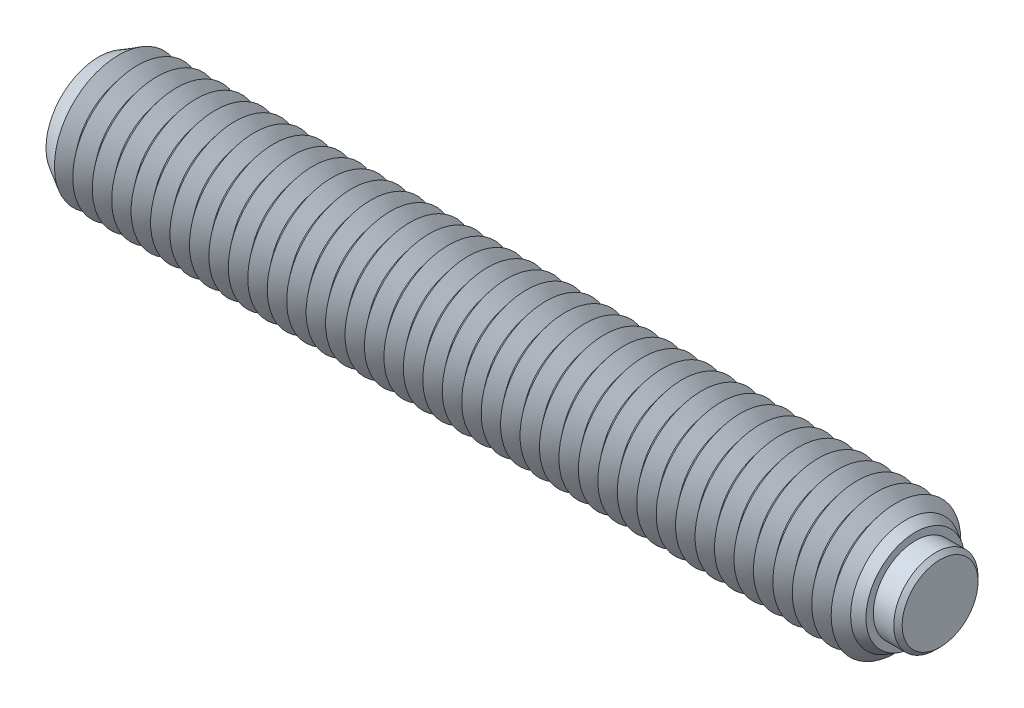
ISO-10303-21;
HEADER;
FILE_DESCRIPTION(('STEP AP214'),'2;1');
FILE_NAME('part.step','',(''),(''),'','','');
FILE_SCHEMA(('AUTOMOTIVE_DESIGN { 1 0 10303 214 1 1 1 1 }'));
ENDSEC;
DATA;
#1=APPLICATION_CONTEXT('core data for automotive mechanical design processes');
#2=APPLICATION_PROTOCOL_DEFINITION('international standard','automotive_design',2000,#1);
#3=PRODUCT_CONTEXT('',#1,'mechanical');
#4=PRODUCT('Part','Part','',(#3));
#5=PRODUCT_RELATED_PRODUCT_CATEGORY('part','',(#4));
#6=PRODUCT_DEFINITION_FORMATION('','',#4);
#7=PRODUCT_DEFINITION_CONTEXT('part definition',#1,'design');
#8=PRODUCT_DEFINITION('design','',#6,#7);
#9=PRODUCT_DEFINITION_SHAPE('','',#8);
#10=(LENGTH_UNIT() NAMED_UNIT(*) SI_UNIT(.MILLI.,.METRE.));
#11=(NAMED_UNIT(*) PLANE_ANGLE_UNIT() SI_UNIT($,.RADIAN.));
#12=(NAMED_UNIT(*) SI_UNIT($,.STERADIAN.) SOLID_ANGLE_UNIT());
#13=UNCERTAINTY_MEASURE_WITH_UNIT(LENGTH_MEASURE(1.E-05),#10,'distance_accuracy_value','');
#14=(GEOMETRIC_REPRESENTATION_CONTEXT(3) GLOBAL_UNCERTAINTY_ASSIGNED_CONTEXT((#13)) GLOBAL_UNIT_ASSIGNED_CONTEXT((#10,
#11,#12)) REPRESENTATION_CONTEXT('',''));
#15=CARTESIAN_POINT('',(0.,0.,0.));
#16=DIRECTION('',(0.,0.,1.));
#17=DIRECTION('',(1.,0.,0.));
#18=AXIS2_PLACEMENT_3D('',#15,#16,#17);
#19=CARTESIAN_POINT('',(2.65,0.,0.));
#20=DIRECTION('',(-1.,0.,0.));
#21=DIRECTION('',(0.,0.,1.));
#22=AXIS2_PLACEMENT_3D('',#19,#20,#21);
#23=CYLINDRICAL_SURFACE('',#22,3.25);
#24=CARTESIAN_POINT('',(2.325,0.,0.));
#25=DIRECTION('',(1.,0.,0.));
#26=DIRECTION('',(0.,0.,-1.));
#27=AXIS2_PLACEMENT_3D('',#24,#25,#26);
#28=CIRCLE('',#27,3.25);
#29=CARTESIAN_POINT('',(2.325,0.,3.25));
#30=VERTEX_POINT('',#29);
#31=EDGE_CURVE('P0_E10',#30,#30,#28,.F.);
#32=CARTESIAN_POINT('',(-1.15,0.,0.));
#33=DIRECTION('',(1.,0.,0.));
#34=DIRECTION('',(0.,0.,-1.));
#35=AXIS2_PLACEMENT_3D('',#32,#33,#34);
#36=CIRCLE('',#35,3.25);
#37=CARTESIAN_POINT('',(-1.15,0.,3.25));
#38=VERTEX_POINT('',#37);
#39=EDGE_CURVE('P0_E25',#38,#38,#36,.T.);
#40=CARTESIAN_POINT('',(2.325,0.,3.25));
#41=CARTESIAN_POINT('',(2.28880208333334,0.,3.25));
#42=CARTESIAN_POINT('',(2.25260416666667,0.,3.25));
#43=CARTESIAN_POINT('',(2.18020833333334,0.,3.25));
#44=CARTESIAN_POINT('',(2.14401041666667,0.,3.25));
#45=CARTESIAN_POINT('',(2.07161458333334,0.,3.25));
#46=CARTESIAN_POINT('',(2.03541666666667,0.,3.25));
#47=CARTESIAN_POINT('',(1.96302083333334,0.,3.25));
#48=CARTESIAN_POINT('',(1.92682291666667,0.,3.25));
#49=CARTESIAN_POINT('',(1.85442708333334,0.,3.25));
#50=CARTESIAN_POINT('',(1.81822916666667,0.,3.25));
#51=CARTESIAN_POINT('',(1.74583333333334,0.,3.25));
#52=CARTESIAN_POINT('',(1.70963541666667,0.,3.25));
#53=CARTESIAN_POINT('',(1.63723958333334,0.,3.25));
#54=CARTESIAN_POINT('',(1.60104166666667,0.,3.25));
#55=CARTESIAN_POINT('',(1.52864583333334,0.,3.25));
#56=CARTESIAN_POINT('',(1.49244791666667,0.,3.25));
#57=CARTESIAN_POINT('',(1.42005208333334,0.,3.25));
#58=CARTESIAN_POINT('',(1.38385416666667,0.,3.25));
#59=CARTESIAN_POINT('',(1.31145833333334,0.,3.25));
#60=CARTESIAN_POINT('',(1.27526041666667,0.,3.25));
#61=CARTESIAN_POINT('',(1.20286458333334,0.,3.25));
#62=CARTESIAN_POINT('',(1.16666666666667,0.,3.25));
#63=CARTESIAN_POINT('',(1.09427083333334,0.,3.25));
#64=CARTESIAN_POINT('',(1.05807291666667,0.,3.25));
#65=CARTESIAN_POINT('',(0.985677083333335,0.,3.25));
#66=CARTESIAN_POINT('',(0.949479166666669,0.,3.25));
#67=CARTESIAN_POINT('',(0.877083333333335,0.,3.25));
#68=CARTESIAN_POINT('',(0.840885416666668,0.,3.25));
#69=CARTESIAN_POINT('',(0.768489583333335,0.,3.25));
#70=CARTESIAN_POINT('',(0.732291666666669,0.,3.25));
#71=CARTESIAN_POINT('',(0.659895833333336,0.,3.25));
#72=CARTESIAN_POINT('',(0.623697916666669,0.,3.25));
#73=CARTESIAN_POINT('',(0.551302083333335,0.,3.25));
#74=CARTESIAN_POINT('',(0.515104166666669,0.,3.25));
#75=CARTESIAN_POINT('',(0.442708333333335,0.,3.25));
#76=CARTESIAN_POINT('',(0.406510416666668,0.,3.25));
#77=CARTESIAN_POINT('',(0.334114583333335,0.,3.25));
#78=CARTESIAN_POINT('',(0.297916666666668,0.,3.25));
#79=CARTESIAN_POINT('',(0.225520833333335,0.,3.25));
#80=CARTESIAN_POINT('',(0.189322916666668,0.,3.25));
#81=CARTESIAN_POINT('',(0.116927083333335,0.,3.25));
#82=CARTESIAN_POINT('',(0.0807291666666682,0.,3.25));
#83=CARTESIAN_POINT('',(0.00833333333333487,0.,3.25));
#84=CARTESIAN_POINT('',(-0.0278645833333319,0.,3.25));
#85=CARTESIAN_POINT('',(-0.100260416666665,0.,3.25));
#86=CARTESIAN_POINT('',(-0.136458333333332,0.,3.25));
#87=CARTESIAN_POINT('',(-0.208854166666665,0.,3.25));
#88=CARTESIAN_POINT('',(-0.245052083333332,0.,3.25));
#89=CARTESIAN_POINT('',(-0.317447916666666,0.,3.25));
#90=CARTESIAN_POINT('',(-0.353645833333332,0.,3.25));
#91=CARTESIAN_POINT('',(-0.426041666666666,0.,3.25));
#92=CARTESIAN_POINT('',(-0.462239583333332,0.,3.25));
#93=CARTESIAN_POINT('',(-0.534635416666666,0.,3.25));
#94=CARTESIAN_POINT('',(-0.570833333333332,0.,3.25));
#95=CARTESIAN_POINT('',(-0.643229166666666,0.,3.25));
#96=CARTESIAN_POINT('',(-0.679427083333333,0.,3.25));
#97=CARTESIAN_POINT('',(-0.751822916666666,0.,3.25));
#98=CARTESIAN_POINT('',(-0.788020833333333,0.,3.25));
#99=CARTESIAN_POINT('',(-0.860416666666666,0.,3.25));
#100=CARTESIAN_POINT('',(-0.896614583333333,0.,3.25));
#101=CARTESIAN_POINT('',(-0.969010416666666,0.,3.25));
#102=CARTESIAN_POINT('',(-1.00520833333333,0.,3.25));
#103=CARTESIAN_POINT('',(-1.07760416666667,0.,3.25));
#104=CARTESIAN_POINT('',(-1.11380208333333,0.,3.25));
#105=CARTESIAN_POINT('',(-1.15,0.,3.25));
#106=B_SPLINE_CURVE_WITH_KNOTS('',3,(#40,#41,#42,#43,#44,#45,#46,#47,#48,#49,#50,#51,#52,#53,
#54,#55,#56,#57,#58,#59,#60,#61,#62,#63,#64,#65,#66,#67,#68,#69,#70,#71,#72,#73,#74,#75,#76,#77,
#78,#79,#80,#81,#82,#83,#84,#85,#86,#87,#88,#89,#90,#91,#92,#93,#94,#95,#96,#97,#98,#99,#100,
#101,#102,#103,#104,#105),.UNSPECIFIED.,.F.,.F.,(4,2,2,2,2,2,2,2,2,2,2,2,2,2,2,2,2,2,2,2,2,2,2,
2,2,2,2,2,2,2,2,2,4),(0.,0.10859375,0.2171875,0.32578125,0.434375,0.54296875,0.6515625,
0.76015625,0.86875,0.977343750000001,1.0859375,1.19453125,1.303125,1.41171875,1.5203125,
1.62890625,1.7375,1.84609375,1.9546875,2.06328125,2.171875,2.28046875,2.3890625,2.49765625,
2.60625,2.71484375,2.8234375,2.93203125,3.040625,3.14921875,3.2578125,3.36640625,3.475),.UNSPECIFIED.);
#107=EDGE_CURVE('P0_BSEAM14',#30,#38,#106,.T.);
#108=ORIENTED_EDGE('',*,*,#31,.T.);
#109=ORIENTED_EDGE('',*,*,#39,.T.);
#110=ORIENTED_EDGE('',*,*,#107,.T.);
#111=ORIENTED_EDGE('',*,*,#107,.F.);
#112=EDGE_LOOP('',(#108,#110,#109,#111));
#113=FACE_BOUND('',#112,.T.);
#114=ADVANCED_FACE('P0_F14',(#113),#23,.T.);
#115=CARTESIAN_POINT('',(2.65,0.,0.));
#116=DIRECTION('',(1.,0.,0.));
#117=DIRECTION('',(0.,0.,-1.));
#118=AXIS2_PLACEMENT_3D('',#115,#116,#117);
#119=PLANE('',#118);
#120=CARTESIAN_POINT('',(2.65,0.,0.));
#121=DIRECTION('',(1.,0.,0.));
#122=DIRECTION('',(0.,0.,-1.));
#123=AXIS2_PLACEMENT_3D('',#120,#121,#122);
#124=CIRCLE('',#123,2.92500000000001);
#125=CARTESIAN_POINT('',(2.65,0.,-2.92500000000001));
#126=VERTEX_POINT('',#125);
#127=EDGE_CURVE('P0_E21',#126,#126,#124,.T.);
#128=ORIENTED_EDGE('',*,*,#127,.T.);
#129=EDGE_LOOP('',(#128));
#130=FACE_BOUND('',#129,.T.);
#131=ADVANCED_FACE('P0_F35',(#130),#119,.T.);
#132=CARTESIAN_POINT('',(-1.15,0.,0.));
#133=DIRECTION('',(1.,0.,0.));
#134=DIRECTION('',(0.,0.,-1.));
#135=AXIS2_PLACEMENT_3D('',#132,#133,#134);
#136=PLANE('',#135);
#137=ORIENTED_EDGE('',*,*,#39,.F.);
#138=EDGE_LOOP('',(#137));
#139=FACE_BOUND('',#138,.T.);
#140=ADVANCED_FACE('P0_F33',(#139),#136,.F.);
#141=CARTESIAN_POINT('',(2.65,0.,0.));
#142=DIRECTION('',(-1.,0.,0.));
#143=DIRECTION('',(0.,0.,1.));
#144=AXIS2_PLACEMENT_3D('',#141,#142,#143);
#145=CONICAL_SURFACE('',#144,2.92500000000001,0.785398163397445);
#146=ORIENTED_EDGE('',*,*,#31,.F.);
#147=EDGE_LOOP('',(#146));
#148=FACE_BOUND('',#147,.T.);
#149=ORIENTED_EDGE('',*,*,#127,.F.);
#150=EDGE_LOOP('',(#149));
#151=FACE_BOUND('',#150,.T.);
#152=ADVANCED_FACE('P0_F16',(#148,#151),#145,.T.);
#153=CLOSED_SHELL('',(#114,#131,#140,#152));
#154=MANIFOLD_SOLID_BREP('P0_B1',#153);
#155=CARTESIAN_POINT('',(-60.75,0.,0.));
#156=DIRECTION('',(-1.,0.,0.));
#157=DIRECTION('',(0.,0.,1.));
#158=AXIS2_PLACEMENT_3D('',#155,#156,#157);
#159=CONICAL_SURFACE('',#158,5.,0.895664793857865);
#160=CARTESIAN_POINT('',(-60.,0.,0.));
#161=DIRECTION('',(1.,0.,0.));
#162=DIRECTION('',(0.,0.,-1.));
#163=AXIS2_PLACEMENT_3D('',#160,#161,#162);
#164=CIRCLE('',#163,4.06325030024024);
#165=CARTESIAN_POINT('',(-60.,0.,-4.06325030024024));
#166=VERTEX_POINT('',#165);
#167=EDGE_CURVE('P1_E1529',#166,#166,#164,.T.);
#168=ORIENTED_EDGE('',*,*,#167,.F.);
#169=EDGE_LOOP('',(#168));
#170=FACE_BOUND('',#169,.T.);
#171=CARTESIAN_POINT('',(-60.7112756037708,0.,0.));
#172=DIRECTION('',(1.,0.,0.));
#173=DIRECTION('',(0.,0.,-1.));
#174=AXIS2_PLACEMENT_3D('',#171,#172,#173);
#175=CIRCLE('',#174,4.95163324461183);
#176=CARTESIAN_POINT('',(-60.7112756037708,0.,-4.95163324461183));
#177=VERTEX_POINT('',#176);
#178=EDGE_CURVE('P1_E1532',#177,#177,#175,.F.);
#179=ORIENTED_EDGE('',*,*,#178,.F.);
#180=EDGE_LOOP('',(#179));
#181=FACE_BOUND('',#180,.T.);
#182=ADVANCED_FACE('P1_F15',(#170,#181),#159,.T.);
#183=CARTESIAN_POINT('',(-1.50000000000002,0.,0.));
#184=DIRECTION('',(1.,0.,0.));
#185=DIRECTION('',(0.,0.,-1.));
#186=AXIS2_PLACEMENT_3D('',#183,#184,#185);
#187=CONICAL_SURFACE('',#186,4.06325030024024,0.895664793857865);
#188=CARTESIAN_POINT('',(-0.750000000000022,0.,0.));
#189=DIRECTION('',(1.,0.,0.));
#190=DIRECTION('',(0.,0.,-1.));
#191=AXIS2_PLACEMENT_3D('',#188,#189,#190);
#192=CIRCLE('',#191,5.);
#193=CARTESIAN_POINT('',(-0.750000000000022,0.,5.00000000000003));
#194=VERTEX_POINT('',#193);
#195=EDGE_CURVE('P1_E1291',#194,#194,#192,.T.);
#196=ORIENTED_EDGE('',*,*,#195,.F.);
#197=EDGE_LOOP('',(#196));
#198=FACE_BOUND('',#197,.T.);
#199=CARTESIAN_POINT('',(-1.50000000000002,0.,0.));
#200=DIRECTION('',(1.,0.,0.));
#201=DIRECTION('',(0.,0.,-1.));
#202=AXIS2_PLACEMENT_3D('',#199,#200,#201);
#203=CIRCLE('',#202,4.06325030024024);
#204=CARTESIAN_POINT('',(-1.50000000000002,0.,-4.06325030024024));
#205=VERTEX_POINT('',#204);
#206=EDGE_CURVE('P1_E1292',#205,#205,#203,.T.);
#207=ORIENTED_EDGE('',*,*,#206,.T.);
#208=EDGE_LOOP('',(#207));
#209=FACE_BOUND('',#208,.T.);
#210=ADVANCED_FACE('P1_F222',(#198,#209),#187,.T.);
#211=CARTESIAN_POINT('',(-2.25000000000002,0.,0.));
#212=DIRECTION('',(-1.,0.,0.));
#213=DIRECTION('',(0.,0.,1.));
#214=AXIS2_PLACEMENT_3D('',#211,#212,#213);
#215=CONICAL_SURFACE('',#214,5.,0.895664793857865);
#216=ORIENTED_EDGE('',*,*,#206,.F.);
#217=EDGE_LOOP('',(#216));
#218=FACE_BOUND('',#217,.T.);
#219=CARTESIAN_POINT('',(-2.25000000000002,0.,0.));
#220=DIRECTION('',(1.,0.,0.));
#221=DIRECTION('',(0.,0.,-1.));
#222=AXIS2_PLACEMENT_3D('',#219,#220,#221);
#223=CIRCLE('',#222,5.);
#224=CARTESIAN_POINT('',(-2.25000000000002,0.,-5.));
#225=VERTEX_POINT('',#224);
#226=EDGE_CURVE('P1_E1296',#225,#225,#223,.T.);
#227=ORIENTED_EDGE('',*,*,#226,.T.);
#228=EDGE_LOOP('',(#227));
#229=FACE_BOUND('',#228,.T.);
#230=ADVANCED_FACE('P1_F227',(#218,#229),#215,.T.);
#231=CARTESIAN_POINT('',(-1.15,0.,0.));
#232=DIRECTION('',(1.,0.,0.));
#233=DIRECTION('',(0.,1.,0.));
#234=AXIS2_PLACEMENT_3D('',#231,#232,#233);
#235=PLANE('',#234);
#236=CARTESIAN_POINT('',(-1.15,0.,0.));
#237=DIRECTION('',(1.,0.,0.));
#238=DIRECTION('',(0.,1.,0.));
#239=AXIS2_PLACEMENT_3D('',#236,#237,#238);
#240=CIRCLE('',#239,3.25);
#241=CARTESIAN_POINT('',(-1.15,3.25,0.));
#242=VERTEX_POINT('',#241);
#243=EDGE_CURVE('P1_E614',#242,#242,#240,.T.);
#244=ORIENTED_EDGE('',*,*,#243,.T.);
#245=EDGE_LOOP('',(#244));
#246=FACE_BOUND('',#245,.T.);
#247=ADVANCED_FACE('P1_F541',(#246),#235,.T.);
#248=CARTESIAN_POINT('',(-1.15,0.,0.));
#249=DIRECTION('',(1.,0.,0.));
#250=DIRECTION('',(0.,1.,0.));
#251=AXIS2_PLACEMENT_3D('',#248,#249,#250);
#252=CYLINDRICAL_SURFACE('',#251,3.25);
#253=CARTESIAN_POINT('',(0.75,0.,0.));
#254=DIRECTION('',(1.,0.,0.));
#255=DIRECTION('',(0.,1.,0.));
#256=AXIS2_PLACEMENT_3D('',#253,#254,#255);
#257=CIRCLE('',#256,3.25);
#258=CARTESIAN_POINT('',(0.75,3.25,0.));
#259=VERTEX_POINT('',#258);
#260=EDGE_CURVE('P1_E617',#259,#259,#257,.T.);
#261=CARTESIAN_POINT('',(-1.15,3.25,0.));
#262=CARTESIAN_POINT('',(-1.13020833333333,3.25,0.));
#263=CARTESIAN_POINT('',(-1.11041666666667,3.25,0.));
#264=CARTESIAN_POINT('',(-1.07083333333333,3.25,0.));
#265=CARTESIAN_POINT('',(-1.05104166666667,3.25,0.));
#266=CARTESIAN_POINT('',(-1.01145833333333,3.25,0.));
#267=CARTESIAN_POINT('',(-0.991666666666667,3.25,0.));
#268=CARTESIAN_POINT('',(-0.952083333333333,3.25,0.));
#269=CARTESIAN_POINT('',(-0.932291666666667,3.25,0.));
#270=CARTESIAN_POINT('',(-0.892708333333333,3.25,0.));
#271=CARTESIAN_POINT('',(-0.872916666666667,3.25,0.));
#272=CARTESIAN_POINT('',(-0.833333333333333,3.25,0.));
#273=CARTESIAN_POINT('',(-0.813541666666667,3.25,0.));
#274=CARTESIAN_POINT('',(-0.773958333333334,3.25,0.));
#275=CARTESIAN_POINT('',(-0.754166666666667,3.25,0.));
#276=CARTESIAN_POINT('',(-0.714583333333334,3.25,0.));
#277=CARTESIAN_POINT('',(-0.694791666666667,3.25,0.));
#278=CARTESIAN_POINT('',(-0.655208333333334,3.25,0.));
#279=CARTESIAN_POINT('',(-0.635416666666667,3.25,0.));
#280=CARTESIAN_POINT('',(-0.595833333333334,3.25,0.));
#281=CARTESIAN_POINT('',(-0.576041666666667,3.25,0.));
#282=CARTESIAN_POINT('',(-0.536458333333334,3.25,0.));
#283=CARTESIAN_POINT('',(-0.516666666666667,3.25,0.));
#284=CARTESIAN_POINT('',(-0.477083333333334,3.25,0.));
#285=CARTESIAN_POINT('',(-0.457291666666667,3.25,0.));
#286=CARTESIAN_POINT('',(-0.417708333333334,3.25,0.));
#287=CARTESIAN_POINT('',(-0.397916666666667,3.25,0.));
#288=CARTESIAN_POINT('',(-0.358333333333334,3.25,0.));
#289=CARTESIAN_POINT('',(-0.338541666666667,3.25,0.));
#290=CARTESIAN_POINT('',(-0.298958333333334,3.25,0.));
#291=CARTESIAN_POINT('',(-0.279166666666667,3.25,0.));
#292=CARTESIAN_POINT('',(-0.239583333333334,3.25,0.));
#293=CARTESIAN_POINT('',(-0.219791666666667,3.25,0.));
#294=CARTESIAN_POINT('',(-0.180208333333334,3.25,0.));
#295=CARTESIAN_POINT('',(-0.160416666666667,3.25,0.));
#296=CARTESIAN_POINT('',(-0.120833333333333,3.25,0.));
#297=CARTESIAN_POINT('',(-0.101041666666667,3.25,0.));
#298=CARTESIAN_POINT('',(-0.0614583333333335,3.25,0.));
#299=CARTESIAN_POINT('',(-0.0416666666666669,3.25,0.));
#300=CARTESIAN_POINT('',(-0.00208333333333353,3.25,0.));
#301=CARTESIAN_POINT('',(0.0177083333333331,3.25,0.));
#302=CARTESIAN_POINT('',(0.0572916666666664,3.25,0.));
#303=CARTESIAN_POINT('',(0.0770833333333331,3.25,0.));
#304=CARTESIAN_POINT('',(0.116666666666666,3.25,0.));
#305=CARTESIAN_POINT('',(0.136458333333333,3.25,0.));
#306=CARTESIAN_POINT('',(0.176041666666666,3.25,0.));
#307=CARTESIAN_POINT('',(0.195833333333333,3.25,0.));
#308=CARTESIAN_POINT('',(0.235416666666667,3.25,0.));
#309=CARTESIAN_POINT('',(0.255208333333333,3.25,0.));
#310=CARTESIAN_POINT('',(0.294791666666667,3.25,0.));
#311=CARTESIAN_POINT('',(0.314583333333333,3.25,0.));
#312=CARTESIAN_POINT('',(0.354166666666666,3.25,0.));
#313=CARTESIAN_POINT('',(0.373958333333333,3.25,0.));
#314=CARTESIAN_POINT('',(0.413541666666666,3.25,0.));
#315=CARTESIAN_POINT('',(0.433333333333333,3.25,0.));
#316=CARTESIAN_POINT('',(0.472916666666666,3.25,0.));
#317=CARTESIAN_POINT('',(0.492708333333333,3.25,0.));
#318=CARTESIAN_POINT('',(0.532291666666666,3.25,0.));
#319=CARTESIAN_POINT('',(0.552083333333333,3.25,0.));
#320=CARTESIAN_POINT('',(0.591666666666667,3.25,0.));
#321=CARTESIAN_POINT('',(0.611458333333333,3.25,0.));
#322=CARTESIAN_POINT('',(0.651041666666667,3.25,0.));
#323=CARTESIAN_POINT('',(0.670833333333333,3.25,0.));
#324=CARTESIAN_POINT('',(0.710416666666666,3.25,0.));
#325=CARTESIAN_POINT('',(0.730208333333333,3.25,0.));
#326=CARTESIAN_POINT('',(0.75,3.25,0.));
#327=B_SPLINE_CURVE_WITH_KNOTS('',3,(#261,#262,#263,#264,#265,#266,#267,#268,#269,#270,#271,
#272,#273,#274,#275,#276,#277,#278,#279,#280,#281,#282,#283,#284,#285,#286,#287,#288,#289,#290,
#291,#292,#293,#294,#295,#296,#297,#298,#299,#300,#301,#302,#303,#304,#305,#306,#307,#308,#309,
#310,#311,#312,#313,#314,#315,#316,#317,#318,#319,#320,#321,#322,#323,#324,#325,#326),
.UNSPECIFIED.,.F.,.F.,(4,2,2,2,2,2,2,2,2,2,2,2,2,2,2,2,2,2,2,2,2,2,2,2,2,2,2,2,2,2,2,2,4),(0.,
0.059375,0.11875,0.178125,0.2375,0.296875,0.35625,0.415625,0.475,0.534375,0.59375,0.653125,
0.7125,0.771875,0.83125,0.890625,0.95,1.009375,1.06875,1.128125,1.1875,1.246875,1.30625,
1.365625,1.425,1.484375,1.54375,1.603125,1.6625,1.721875,1.78125,1.840625,1.9),.UNSPECIFIED.);
#328=EDGE_CURVE('P1_BSEAM209',#242,#259,#327,.T.);
#329=ORIENTED_EDGE('',*,*,#243,.F.);
#330=ORIENTED_EDGE('',*,*,#260,.T.);
#331=ORIENTED_EDGE('',*,*,#328,.T.);
#332=ORIENTED_EDGE('',*,*,#328,.F.);
#333=EDGE_LOOP('',(#329,#331,#330,#332));
#334=FACE_BOUND('',#333,.T.);
#335=ADVANCED_FACE('P1_F209',(#334),#252,.F.);
#336=CARTESIAN_POINT('',(0.75,3.81698729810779,0.));
#337=DIRECTION('',(1.,0.,0.));
#338=DIRECTION('',(0.,1.,0.));
#339=AXIS2_PLACEMENT_3D('',#336,#337,#338);
#340=PLANE('',#339);
#341=ORIENTED_EDGE('',*,*,#260,.F.);
#342=EDGE_LOOP('',(#341));
#343=FACE_BOUND('',#342,.T.);
#344=CARTESIAN_POINT('',(0.75,0.,0.));
#345=DIRECTION('',(1.,0.,0.));
#346=DIRECTION('',(0.,1.,0.));
#347=AXIS2_PLACEMENT_3D('',#344,#345,#346);
#348=CIRCLE('',#347,3.81698729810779);
#349=CARTESIAN_POINT('',(0.75,3.81698729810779,0.));
#350=VERTEX_POINT('',#349);
#351=EDGE_CURVE('P1_E121',#350,#350,#348,.T.);
#352=ORIENTED_EDGE('',*,*,#351,.T.);
#353=EDGE_LOOP('',(#352));
#354=FACE_BOUND('',#353,.T.);
#355=ADVANCED_FACE('P1_F206',(#343,#354),#340,.T.);
#356=CARTESIAN_POINT('',(0.75,0.,0.));
#357=DIRECTION('',(-1.,0.,0.));
#358=DIRECTION('',(0.,-1.,0.));
#359=AXIS2_PLACEMENT_3D('',#356,#357,#358);
#360=CONICAL_SURFACE('',#359,3.81698729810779,0.523598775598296);
#361=CARTESIAN_POINT('',(0.,0.,0.));
#362=DIRECTION('',(1.,0.,0.));
#363=DIRECTION('',(0.,0.,-1.));
#364=AXIS2_PLACEMENT_3D('',#361,#362,#363);
#365=CIRCLE('',#364,4.25);
#366=CARTESIAN_POINT('',(0.,0.,4.25));
#367=VERTEX_POINT('',#366);
#368=EDGE_CURVE('P1_E605',#367,#367,#365,.T.);
#369=ORIENTED_EDGE('',*,*,#368,.T.);
#370=EDGE_LOOP('',(#369));
#371=FACE_BOUND('',#370,.T.);
#372=ORIENTED_EDGE('',*,*,#351,.F.);
#373=EDGE_LOOP('',(#372));
#374=FACE_BOUND('',#373,.T.);
#375=ADVANCED_FACE('P1_F203',(#371,#374),#360,.T.);
#376=CARTESIAN_POINT('',(0.,0.,0.));
#377=DIRECTION('',(-1.,0.,0.));
#378=DIRECTION('',(0.,0.,1.));
#379=AXIS2_PLACEMENT_3D('',#376,#377,#378);
#380=CONICAL_SURFACE('',#379,4.25,0.785398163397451);
#381=CARTESIAN_POINT('',(-0.750000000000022,0.,5.00000000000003));
#382=CARTESIAN_POINT('',(-0.742187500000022,0.,4.99218750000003));
#383=CARTESIAN_POINT('',(-0.734375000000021,0.,4.98437500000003));
#384=CARTESIAN_POINT('',(-0.718750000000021,0.,4.96875000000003));
#385=CARTESIAN_POINT('',(-0.71093750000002,0.,4.96093750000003));
#386=CARTESIAN_POINT('',(-0.69531250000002,0.,4.94531250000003));
#387=CARTESIAN_POINT('',(-0.68750000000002,0.,4.93750000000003));
#388=CARTESIAN_POINT('',(-0.671875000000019,0.,4.92187500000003));
#389=CARTESIAN_POINT('',(-0.664062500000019,0.,4.91406250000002));
#390=CARTESIAN_POINT('',(-0.648437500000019,0.,4.89843750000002));
#391=CARTESIAN_POINT('',(-0.640625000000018,0.,4.89062500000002));
#392=CARTESIAN_POINT('',(-0.625000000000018,0.,4.87500000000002));
#393=CARTESIAN_POINT('',(-0.617187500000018,0.,4.86718750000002));
#394=CARTESIAN_POINT('',(-0.601562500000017,0.,4.85156250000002));
#395=CARTESIAN_POINT('',(-0.593750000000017,0.,4.84375000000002));
#396=CARTESIAN_POINT('',(-0.578125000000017,0.,4.82812500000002));
#397=CARTESIAN_POINT('',(-0.570312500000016,0.,4.82031250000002));
#398=CARTESIAN_POINT('',(-0.554687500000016,0.,4.80468750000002));
#399=CARTESIAN_POINT('',(-0.546875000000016,0.,4.79687500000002));
#400=CARTESIAN_POINT('',(-0.531250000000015,0.,4.78125000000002));
#401=CARTESIAN_POINT('',(-0.523437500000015,0.,4.77343750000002));
#402=CARTESIAN_POINT('',(-0.507812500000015,0.,4.75781250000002));
#403=CARTESIAN_POINT('',(-0.500000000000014,0.,4.75000000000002));
#404=CARTESIAN_POINT('',(-0.484375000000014,0.,4.73437500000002));
#405=CARTESIAN_POINT('',(-0.476562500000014,0.,4.72656250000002));
#406=CARTESIAN_POINT('',(-0.460937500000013,0.,4.71093750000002));
#407=CARTESIAN_POINT('',(-0.453125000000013,0.,4.70312500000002));
#408=CARTESIAN_POINT('',(-0.437500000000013,0.,4.68750000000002));
#409=CARTESIAN_POINT('',(-0.429687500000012,0.,4.67968750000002));
#410=CARTESIAN_POINT('',(-0.414062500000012,0.,4.66406250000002));
#411=CARTESIAN_POINT('',(-0.406250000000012,0.,4.65625000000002));
#412=CARTESIAN_POINT('',(-0.390625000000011,0.,4.64062500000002));
#413=CARTESIAN_POINT('',(-0.382812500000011,0.,4.63281250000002));
#414=CARTESIAN_POINT('',(-0.367187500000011,0.,4.61718750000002));
#415=CARTESIAN_POINT('',(-0.35937500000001,0.,4.60937500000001));
#416=CARTESIAN_POINT('',(-0.34375000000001,0.,4.59375000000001));
#417=CARTESIAN_POINT('',(-0.33593750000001,0.,4.58593750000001));
#418=CARTESIAN_POINT('',(-0.320312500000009,0.,4.57031250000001));
#419=CARTESIAN_POINT('',(-0.312500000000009,0.,4.56250000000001));
#420=CARTESIAN_POINT('',(-0.296875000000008,0.,4.54687500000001));
#421=CARTESIAN_POINT('',(-0.289062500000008,0.,4.53906250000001));
#422=CARTESIAN_POINT('',(-0.273437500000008,0.,4.52343750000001));
#423=CARTESIAN_POINT('',(-0.265625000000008,0.,4.51562500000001));
#424=CARTESIAN_POINT('',(-0.250000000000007,0.,4.50000000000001));
#425=CARTESIAN_POINT('',(-0.242187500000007,0.,4.49218750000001));
#426=CARTESIAN_POINT('',(-0.226562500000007,0.,4.47656250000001));
#427=CARTESIAN_POINT('',(-0.218750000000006,0.,4.46875000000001));
#428=CARTESIAN_POINT('',(-0.203125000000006,0.,4.45312500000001));
#429=CARTESIAN_POINT('',(-0.195312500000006,0.,4.44531250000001));
#430=CARTESIAN_POINT('',(-0.179687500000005,0.,4.42968750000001));
#431=CARTESIAN_POINT('',(-0.171875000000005,0.,4.42187500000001));
#432=CARTESIAN_POINT('',(-0.156250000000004,0.,4.40625000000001));
#433=CARTESIAN_POINT('',(-0.148437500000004,0.,4.39843750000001));
#434=CARTESIAN_POINT('',(-0.132812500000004,0.,4.38281250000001));
#435=CARTESIAN_POINT('',(-0.125000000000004,0.,4.37500000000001));
#436=CARTESIAN_POINT('',(-0.109375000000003,0.,4.35937500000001));
#437=CARTESIAN_POINT('',(-0.101562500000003,0.,4.35156250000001));
#438=CARTESIAN_POINT('',(-0.0859375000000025,0.,4.33593750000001));
#439=CARTESIAN_POINT('',(-0.0781250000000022,0.,4.32812500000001));
#440=CARTESIAN_POINT('',(-0.0625000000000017,0.,4.31250000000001));
#441=CARTESIAN_POINT('',(-0.0546875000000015,0.,4.3046875));
#442=CARTESIAN_POINT('',(-0.0390625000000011,0.,4.2890625));
#443=CARTESIAN_POINT('',(-0.0312500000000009,0.,4.28125));
#444=CARTESIAN_POINT('',(-0.0156250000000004,0.,4.265625));
#445=CARTESIAN_POINT('',(-0.00781250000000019,0.,4.2578125));
#446=CARTESIAN_POINT('',(0.,0.,4.25));
#447=B_SPLINE_CURVE_WITH_KNOTS('',3,(#381,#382,#383,#384,#385,#386,#387,#388,#389,#390,#391,
#392,#393,#394,#395,#396,#397,#398,#399,#400,#401,#402,#403,#404,#405,#406,#407,#408,#409,#410,
#411,#412,#413,#414,#415,#416,#417,#418,#419,#420,#421,#422,#423,#424,#425,#426,#427,#428,#429,
#430,#431,#432,#433,#434,#435,#436,#437,#438,#439,#440,#441,#442,#443,#444,#445,#446),
.UNSPECIFIED.,.F.,.F.,(4,2,2,2,2,2,2,2,2,2,2,2,2,2,2,2,2,2,2,2,2,2,2,2,2,2,2,2,2,2,2,2,4),(0.,
0.0331456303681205,0.0662912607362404,0.0994368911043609,0.132582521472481,0.165728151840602,
0.198873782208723,0.232019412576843,0.265165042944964,0.298310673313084,0.331456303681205,
0.364601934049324,0.397747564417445,0.430893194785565,0.464038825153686,0.497184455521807,
0.530330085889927,0.563475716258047,0.596621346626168,0.629766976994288,0.662912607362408,
0.696058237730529,0.729203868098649,0.76234949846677,0.79549512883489,0.828640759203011,
0.861786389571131,0.894932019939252,0.928077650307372,0.961223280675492,0.994368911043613,
1.02751454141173,1.06066017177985),.UNSPECIFIED.);
#448=EDGE_CURVE('P1_BSEAM17',#194,#367,#447,.T.);
#449=ORIENTED_EDGE('',*,*,#195,.T.);
#450=ORIENTED_EDGE('',*,*,#368,.F.);
#451=ORIENTED_EDGE('',*,*,#448,.T.);
#452=ORIENTED_EDGE('',*,*,#448,.F.);
#453=EDGE_LOOP('',(#449,#451,#450,#452));
#454=FACE_BOUND('',#453,.T.);
#455=ADVANCED_FACE('P1_F17',(#454),#380,.T.);
#456=CARTESIAN_POINT('',(-3.00000000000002,0.,0.));
#457=DIRECTION('',(1.,0.,0.));
#458=DIRECTION('',(0.,0.,-1.));
#459=AXIS2_PLACEMENT_3D('',#456,#457,#458);
#460=CONICAL_SURFACE('',#459,4.06325030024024,0.895664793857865);
#461=ORIENTED_EDGE('',*,*,#226,.F.);
#462=EDGE_LOOP('',(#461));
#463=FACE_BOUND('',#462,.T.);
#464=CARTESIAN_POINT('',(-3.00000000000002,0.,0.));
#465=DIRECTION('',(1.,0.,0.));
#466=DIRECTION('',(0.,0.,-1.));
#467=AXIS2_PLACEMENT_3D('',#464,#465,#466);
#468=CIRCLE('',#467,4.06325030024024);
#469=CARTESIAN_POINT('',(-3.00000000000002,0.,-4.06325030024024));
#470=VERTEX_POINT('',#469);
#471=EDGE_CURVE('P1_E1301',#470,#470,#468,.T.);
#472=ORIENTED_EDGE('',*,*,#471,.T.);
#473=EDGE_LOOP('',(#472));
#474=FACE_BOUND('',#473,.T.);
#475=ADVANCED_FACE('P1_F535',(#463,#474),#460,.T.);
#476=CARTESIAN_POINT('',(-3.75000000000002,0.,0.));
#477=DIRECTION('',(-1.,0.,0.));
#478=DIRECTION('',(0.,0.,1.));
#479=AXIS2_PLACEMENT_3D('',#476,#477,#478);
#480=CONICAL_SURFACE('',#479,5.,0.895664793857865);
#481=ORIENTED_EDGE('',*,*,#471,.F.);
#482=EDGE_LOOP('',(#481));
#483=FACE_BOUND('',#482,.T.);
#484=CARTESIAN_POINT('',(-3.75000000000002,0.,0.));
#485=DIRECTION('',(1.,0.,0.));
#486=DIRECTION('',(0.,0.,-1.));
#487=AXIS2_PLACEMENT_3D('',#484,#485,#486);
#488=CIRCLE('',#487,5.);
#489=CARTESIAN_POINT('',(-3.75000000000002,0.,-5.));
#490=VERTEX_POINT('',#489);
#491=EDGE_CURVE('P1_E1304',#490,#490,#488,.T.);
#492=ORIENTED_EDGE('',*,*,#491,.T.);
#493=EDGE_LOOP('',(#492));
#494=FACE_BOUND('',#493,.T.);
#495=ADVANCED_FACE('P1_F531',(#483,#494),#480,.T.);
#496=CARTESIAN_POINT('',(-4.50000000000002,0.,0.));
#497=DIRECTION('',(1.,0.,0.));
#498=DIRECTION('',(0.,0.,-1.));
#499=AXIS2_PLACEMENT_3D('',#496,#497,#498);
#500=CONICAL_SURFACE('',#499,4.06325030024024,0.895664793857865);
#501=ORIENTED_EDGE('',*,*,#491,.F.);
#502=EDGE_LOOP('',(#501));
#503=FACE_BOUND('',#502,.T.);
#504=CARTESIAN_POINT('',(-4.50000000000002,0.,0.));
#505=DIRECTION('',(1.,0.,0.));
#506=DIRECTION('',(0.,0.,-1.));
#507=AXIS2_PLACEMENT_3D('',#504,#505,#506);
#508=CIRCLE('',#507,4.06325030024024);
#509=CARTESIAN_POINT('',(-4.50000000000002,0.,-4.06325030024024));
#510=VERTEX_POINT('',#509);
#511=EDGE_CURVE('P1_E1307',#510,#510,#508,.T.);
#512=ORIENTED_EDGE('',*,*,#511,.T.);
#513=EDGE_LOOP('',(#512));
#514=FACE_BOUND('',#513,.T.);
#515=ADVANCED_FACE('P1_F527',(#503,#514),#500,.T.);
#516=CARTESIAN_POINT('',(-5.25000000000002,0.,0.));
#517=DIRECTION('',(-1.,0.,0.));
#518=DIRECTION('',(0.,0.,1.));
#519=AXIS2_PLACEMENT_3D('',#516,#517,#518);
#520=CONICAL_SURFACE('',#519,5.,0.895664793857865);
#521=ORIENTED_EDGE('',*,*,#511,.F.);
#522=EDGE_LOOP('',(#521));
#523=FACE_BOUND('',#522,.T.);
#524=CARTESIAN_POINT('',(-5.25000000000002,0.,0.));
#525=DIRECTION('',(1.,0.,0.));
#526=DIRECTION('',(0.,0.,-1.));
#527=AXIS2_PLACEMENT_3D('',#524,#525,#526);
#528=CIRCLE('',#527,5.);
#529=CARTESIAN_POINT('',(-5.25000000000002,0.,-5.));
#530=VERTEX_POINT('',#529);
#531=EDGE_CURVE('P1_E1310',#530,#530,#528,.T.);
#532=ORIENTED_EDGE('',*,*,#531,.T.);
#533=EDGE_LOOP('',(#532));
#534=FACE_BOUND('',#533,.T.);
#535=ADVANCED_FACE('P1_F523',(#523,#534),#520,.T.);
#536=CARTESIAN_POINT('',(-6.00000000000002,0.,0.));
#537=DIRECTION('',(1.,0.,0.));
#538=DIRECTION('',(0.,0.,-1.));
#539=AXIS2_PLACEMENT_3D('',#536,#537,#538);
#540=CONICAL_SURFACE('',#539,4.06325030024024,0.895664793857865);
#541=ORIENTED_EDGE('',*,*,#531,.F.);
#542=EDGE_LOOP('',(#541));
#543=FACE_BOUND('',#542,.T.);
#544=CARTESIAN_POINT('',(-6.00000000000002,0.,0.));
#545=DIRECTION('',(1.,0.,0.));
#546=DIRECTION('',(0.,0.,-1.));
#547=AXIS2_PLACEMENT_3D('',#544,#545,#546);
#548=CIRCLE('',#547,4.06325030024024);
#549=CARTESIAN_POINT('',(-6.00000000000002,0.,-4.06325030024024));
#550=VERTEX_POINT('',#549);
#551=EDGE_CURVE('P1_E1313',#550,#550,#548,.T.);
#552=ORIENTED_EDGE('',*,*,#551,.T.);
#553=EDGE_LOOP('',(#552));
#554=FACE_BOUND('',#553,.T.);
#555=ADVANCED_FACE('P1_F519',(#543,#554),#540,.T.);
#556=CARTESIAN_POINT('',(-6.75000000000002,0.,0.));
#557=DIRECTION('',(-1.,0.,0.));
#558=DIRECTION('',(0.,0.,1.));
#559=AXIS2_PLACEMENT_3D('',#556,#557,#558);
#560=CONICAL_SURFACE('',#559,5.,0.895664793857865);
#561=ORIENTED_EDGE('',*,*,#551,.F.);
#562=EDGE_LOOP('',(#561));
#563=FACE_BOUND('',#562,.T.);
#564=CARTESIAN_POINT('',(-6.75000000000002,0.,0.));
#565=DIRECTION('',(1.,0.,0.));
#566=DIRECTION('',(0.,0.,-1.));
#567=AXIS2_PLACEMENT_3D('',#564,#565,#566);
#568=CIRCLE('',#567,5.);
#569=CARTESIAN_POINT('',(-6.75000000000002,0.,-5.));
#570=VERTEX_POINT('',#569);
#571=EDGE_CURVE('P1_E1316',#570,#570,#568,.T.);
#572=ORIENTED_EDGE('',*,*,#571,.T.);
#573=EDGE_LOOP('',(#572));
#574=FACE_BOUND('',#573,.T.);
#575=ADVANCED_FACE('P1_F515',(#563,#574),#560,.T.);
#576=CARTESIAN_POINT('',(-7.50000000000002,0.,0.));
#577=DIRECTION('',(1.,0.,0.));
#578=DIRECTION('',(0.,0.,-1.));
#579=AXIS2_PLACEMENT_3D('',#576,#577,#578);
#580=CONICAL_SURFACE('',#579,4.06325030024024,0.895664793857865);
#581=ORIENTED_EDGE('',*,*,#571,.F.);
#582=EDGE_LOOP('',(#581));
#583=FACE_BOUND('',#582,.T.);
#584=CARTESIAN_POINT('',(-7.50000000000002,0.,0.));
#585=DIRECTION('',(1.,0.,0.));
#586=DIRECTION('',(0.,0.,-1.));
#587=AXIS2_PLACEMENT_3D('',#584,#585,#586);
#588=CIRCLE('',#587,4.06325030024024);
#589=CARTESIAN_POINT('',(-7.50000000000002,0.,-4.06325030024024));
#590=VERTEX_POINT('',#589);
#591=EDGE_CURVE('P1_E1319',#590,#590,#588,.T.);
#592=ORIENTED_EDGE('',*,*,#591,.T.);
#593=EDGE_LOOP('',(#592));
#594=FACE_BOUND('',#593,.T.);
#595=ADVANCED_FACE('P1_F511',(#583,#594),#580,.T.);
#596=CARTESIAN_POINT('',(-8.25000000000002,0.,0.));
#597=DIRECTION('',(-1.,0.,0.));
#598=DIRECTION('',(0.,0.,1.));
#599=AXIS2_PLACEMENT_3D('',#596,#597,#598);
#600=CONICAL_SURFACE('',#599,5.,0.895664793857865);
#601=ORIENTED_EDGE('',*,*,#591,.F.);
#602=EDGE_LOOP('',(#601));
#603=FACE_BOUND('',#602,.T.);
#604=CARTESIAN_POINT('',(-8.25000000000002,0.,0.));
#605=DIRECTION('',(1.,0.,0.));
#606=DIRECTION('',(0.,0.,-1.));
#607=AXIS2_PLACEMENT_3D('',#604,#605,#606);
#608=CIRCLE('',#607,5.);
#609=CARTESIAN_POINT('',(-8.25000000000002,0.,-5.));
#610=VERTEX_POINT('',#609);
#611=EDGE_CURVE('P1_E1322',#610,#610,#608,.T.);
#612=ORIENTED_EDGE('',*,*,#611,.T.);
#613=EDGE_LOOP('',(#612));
#614=FACE_BOUND('',#613,.T.);
#615=ADVANCED_FACE('P1_F507',(#603,#614),#600,.T.);
#616=CARTESIAN_POINT('',(-9.00000000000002,0.,0.));
#617=DIRECTION('',(1.,0.,0.));
#618=DIRECTION('',(0.,0.,-1.));
#619=AXIS2_PLACEMENT_3D('',#616,#617,#618);
#620=CONICAL_SURFACE('',#619,4.06325030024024,0.895664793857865);
#621=ORIENTED_EDGE('',*,*,#611,.F.);
#622=EDGE_LOOP('',(#621));
#623=FACE_BOUND('',#622,.T.);
#624=CARTESIAN_POINT('',(-9.00000000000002,0.,0.));
#625=DIRECTION('',(1.,0.,0.));
#626=DIRECTION('',(0.,0.,-1.));
#627=AXIS2_PLACEMENT_3D('',#624,#625,#626);
#628=CIRCLE('',#627,4.06325030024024);
#629=CARTESIAN_POINT('',(-9.00000000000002,0.,-4.06325030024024));
#630=VERTEX_POINT('',#629);
#631=EDGE_CURVE('P1_E1325',#630,#630,#628,.T.);
#632=ORIENTED_EDGE('',*,*,#631,.T.);
#633=EDGE_LOOP('',(#632));
#634=FACE_BOUND('',#633,.T.);
#635=ADVANCED_FACE('P1_F503',(#623,#634),#620,.T.);
#636=CARTESIAN_POINT('',(-9.75000000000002,0.,0.));
#637=DIRECTION('',(-1.,0.,0.));
#638=DIRECTION('',(0.,0.,1.));
#639=AXIS2_PLACEMENT_3D('',#636,#637,#638);
#640=CONICAL_SURFACE('',#639,5.,0.895664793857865);
#641=ORIENTED_EDGE('',*,*,#631,.F.);
#642=EDGE_LOOP('',(#641));
#643=FACE_BOUND('',#642,.T.);
#644=CARTESIAN_POINT('',(-9.75000000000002,0.,0.));
#645=DIRECTION('',(1.,0.,0.));
#646=DIRECTION('',(0.,0.,-1.));
#647=AXIS2_PLACEMENT_3D('',#644,#645,#646);
#648=CIRCLE('',#647,5.);
#649=CARTESIAN_POINT('',(-9.75000000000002,0.,-5.));
#650=VERTEX_POINT('',#649);
#651=EDGE_CURVE('P1_E1328',#650,#650,#648,.T.);
#652=ORIENTED_EDGE('',*,*,#651,.T.);
#653=EDGE_LOOP('',(#652));
#654=FACE_BOUND('',#653,.T.);
#655=ADVANCED_FACE('P1_F499',(#643,#654),#640,.T.);
#656=CARTESIAN_POINT('',(-10.5,0.,0.));
#657=DIRECTION('',(1.,0.,0.));
#658=DIRECTION('',(0.,0.,-1.));
#659=AXIS2_PLACEMENT_3D('',#656,#657,#658);
#660=CONICAL_SURFACE('',#659,4.06325030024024,0.895664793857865);
#661=ORIENTED_EDGE('',*,*,#651,.F.);
#662=EDGE_LOOP('',(#661));
#663=FACE_BOUND('',#662,.T.);
#664=CARTESIAN_POINT('',(-10.5,0.,0.));
#665=DIRECTION('',(1.,0.,0.));
#666=DIRECTION('',(0.,0.,-1.));
#667=AXIS2_PLACEMENT_3D('',#664,#665,#666);
#668=CIRCLE('',#667,4.06325030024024);
#669=CARTESIAN_POINT('',(-10.5,0.,-4.06325030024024));
#670=VERTEX_POINT('',#669);
#671=EDGE_CURVE('P1_E1331',#670,#670,#668,.T.);
#672=ORIENTED_EDGE('',*,*,#671,.T.);
#673=EDGE_LOOP('',(#672));
#674=FACE_BOUND('',#673,.T.);
#675=ADVANCED_FACE('P1_F495',(#663,#674),#660,.T.);
#676=CARTESIAN_POINT('',(-11.25,0.,0.));
#677=DIRECTION('',(-1.,0.,0.));
#678=DIRECTION('',(0.,0.,1.));
#679=AXIS2_PLACEMENT_3D('',#676,#677,#678);
#680=CONICAL_SURFACE('',#679,5.,0.895664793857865);
#681=ORIENTED_EDGE('',*,*,#671,.F.);
#682=EDGE_LOOP('',(#681));
#683=FACE_BOUND('',#682,.T.);
#684=CARTESIAN_POINT('',(-11.25,0.,0.));
#685=DIRECTION('',(1.,0.,0.));
#686=DIRECTION('',(0.,0.,-1.));
#687=AXIS2_PLACEMENT_3D('',#684,#685,#686);
#688=CIRCLE('',#687,5.);
#689=CARTESIAN_POINT('',(-11.25,0.,-5.));
#690=VERTEX_POINT('',#689);
#691=EDGE_CURVE('P1_E1334',#690,#690,#688,.T.);
#692=ORIENTED_EDGE('',*,*,#691,.T.);
#693=EDGE_LOOP('',(#692));
#694=FACE_BOUND('',#693,.T.);
#695=ADVANCED_FACE('P1_F491',(#683,#694),#680,.T.);
#696=CARTESIAN_POINT('',(-12.,0.,0.));
#697=DIRECTION('',(1.,0.,0.));
#698=DIRECTION('',(0.,0.,-1.));
#699=AXIS2_PLACEMENT_3D('',#696,#697,#698);
#700=CONICAL_SURFACE('',#699,4.06325030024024,0.895664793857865);
#701=ORIENTED_EDGE('',*,*,#691,.F.);
#702=EDGE_LOOP('',(#701));
#703=FACE_BOUND('',#702,.T.);
#704=CARTESIAN_POINT('',(-12.,0.,0.));
#705=DIRECTION('',(1.,0.,0.));
#706=DIRECTION('',(0.,0.,-1.));
#707=AXIS2_PLACEMENT_3D('',#704,#705,#706);
#708=CIRCLE('',#707,4.06325030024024);
#709=CARTESIAN_POINT('',(-12.,0.,-4.06325030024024));
#710=VERTEX_POINT('',#709);
#711=EDGE_CURVE('P1_E1337',#710,#710,#708,.T.);
#712=ORIENTED_EDGE('',*,*,#711,.T.);
#713=EDGE_LOOP('',(#712));
#714=FACE_BOUND('',#713,.T.);
#715=ADVANCED_FACE('P1_F487',(#703,#714),#700,.T.);
#716=CARTESIAN_POINT('',(-12.75,0.,0.));
#717=DIRECTION('',(-1.,0.,0.));
#718=DIRECTION('',(0.,0.,1.));
#719=AXIS2_PLACEMENT_3D('',#716,#717,#718);
#720=CONICAL_SURFACE('',#719,5.,0.895664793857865);
#721=ORIENTED_EDGE('',*,*,#711,.F.);
#722=EDGE_LOOP('',(#721));
#723=FACE_BOUND('',#722,.T.);
#724=CARTESIAN_POINT('',(-12.75,0.,0.));
#725=DIRECTION('',(1.,0.,0.));
#726=DIRECTION('',(0.,0.,-1.));
#727=AXIS2_PLACEMENT_3D('',#724,#725,#726);
#728=CIRCLE('',#727,5.);
#729=CARTESIAN_POINT('',(-12.75,0.,-5.));
#730=VERTEX_POINT('',#729);
#731=EDGE_CURVE('P1_E1340',#730,#730,#728,.T.);
#732=ORIENTED_EDGE('',*,*,#731,.T.);
#733=EDGE_LOOP('',(#732));
#734=FACE_BOUND('',#733,.T.);
#735=ADVANCED_FACE('P1_F483',(#723,#734),#720,.T.);
#736=CARTESIAN_POINT('',(-13.5,0.,0.));
#737=DIRECTION('',(1.,0.,0.));
#738=DIRECTION('',(0.,0.,-1.));
#739=AXIS2_PLACEMENT_3D('',#736,#737,#738);
#740=CONICAL_SURFACE('',#739,4.06325030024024,0.895664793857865);
#741=ORIENTED_EDGE('',*,*,#731,.F.);
#742=EDGE_LOOP('',(#741));
#743=FACE_BOUND('',#742,.T.);
#744=CARTESIAN_POINT('',(-13.5,0.,0.));
#745=DIRECTION('',(1.,0.,0.));
#746=DIRECTION('',(0.,0.,-1.));
#747=AXIS2_PLACEMENT_3D('',#744,#745,#746);
#748=CIRCLE('',#747,4.06325030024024);
#749=CARTESIAN_POINT('',(-13.5,0.,-4.06325030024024));
#750=VERTEX_POINT('',#749);
#751=EDGE_CURVE('P1_E1343',#750,#750,#748,.T.);
#752=ORIENTED_EDGE('',*,*,#751,.T.);
#753=EDGE_LOOP('',(#752));
#754=FACE_BOUND('',#753,.T.);
#755=ADVANCED_FACE('P1_F479',(#743,#754),#740,.T.);
#756=CARTESIAN_POINT('',(-14.25,0.,0.));
#757=DIRECTION('',(-1.,0.,0.));
#758=DIRECTION('',(0.,0.,1.));
#759=AXIS2_PLACEMENT_3D('',#756,#757,#758);
#760=CONICAL_SURFACE('',#759,5.,0.895664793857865);
#761=ORIENTED_EDGE('',*,*,#751,.F.);
#762=EDGE_LOOP('',(#761));
#763=FACE_BOUND('',#762,.T.);
#764=CARTESIAN_POINT('',(-14.25,0.,0.));
#765=DIRECTION('',(1.,0.,0.));
#766=DIRECTION('',(0.,0.,-1.));
#767=AXIS2_PLACEMENT_3D('',#764,#765,#766);
#768=CIRCLE('',#767,5.);
#769=CARTESIAN_POINT('',(-14.25,0.,-5.));
#770=VERTEX_POINT('',#769);
#771=EDGE_CURVE('P1_E1346',#770,#770,#768,.T.);
#772=ORIENTED_EDGE('',*,*,#771,.T.);
#773=EDGE_LOOP('',(#772));
#774=FACE_BOUND('',#773,.T.);
#775=ADVANCED_FACE('P1_F475',(#763,#774),#760,.T.);
#776=CARTESIAN_POINT('',(-15.,0.,0.));
#777=DIRECTION('',(1.,0.,0.));
#778=DIRECTION('',(0.,0.,-1.));
#779=AXIS2_PLACEMENT_3D('',#776,#777,#778);
#780=CONICAL_SURFACE('',#779,4.06325030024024,0.895664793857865);
#781=ORIENTED_EDGE('',*,*,#771,.F.);
#782=EDGE_LOOP('',(#781));
#783=FACE_BOUND('',#782,.T.);
#784=CARTESIAN_POINT('',(-15.,0.,0.));
#785=DIRECTION('',(1.,0.,0.));
#786=DIRECTION('',(0.,0.,-1.));
#787=AXIS2_PLACEMENT_3D('',#784,#785,#786);
#788=CIRCLE('',#787,4.06325030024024);
#789=CARTESIAN_POINT('',(-15.,0.,-4.06325030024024));
#790=VERTEX_POINT('',#789);
#791=EDGE_CURVE('P1_E1349',#790,#790,#788,.T.);
#792=ORIENTED_EDGE('',*,*,#791,.T.);
#793=EDGE_LOOP('',(#792));
#794=FACE_BOUND('',#793,.T.);
#795=ADVANCED_FACE('P1_F471',(#783,#794),#780,.T.);
#796=CARTESIAN_POINT('',(-15.75,0.,0.));
#797=DIRECTION('',(-1.,0.,0.));
#798=DIRECTION('',(0.,0.,1.));
#799=AXIS2_PLACEMENT_3D('',#796,#797,#798);
#800=CONICAL_SURFACE('',#799,5.,0.895664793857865);
#801=ORIENTED_EDGE('',*,*,#791,.F.);
#802=EDGE_LOOP('',(#801));
#803=FACE_BOUND('',#802,.T.);
#804=CARTESIAN_POINT('',(-15.75,0.,0.));
#805=DIRECTION('',(1.,0.,0.));
#806=DIRECTION('',(0.,0.,-1.));
#807=AXIS2_PLACEMENT_3D('',#804,#805,#806);
#808=CIRCLE('',#807,5.);
#809=CARTESIAN_POINT('',(-15.75,0.,-5.));
#810=VERTEX_POINT('',#809);
#811=EDGE_CURVE('P1_E1352',#810,#810,#808,.T.);
#812=ORIENTED_EDGE('',*,*,#811,.T.);
#813=EDGE_LOOP('',(#812));
#814=FACE_BOUND('',#813,.T.);
#815=ADVANCED_FACE('P1_F467',(#803,#814),#800,.T.);
#816=CARTESIAN_POINT('',(-16.5,0.,0.));
#817=DIRECTION('',(1.,0.,0.));
#818=DIRECTION('',(0.,0.,-1.));
#819=AXIS2_PLACEMENT_3D('',#816,#817,#818);
#820=CONICAL_SURFACE('',#819,4.06325030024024,0.895664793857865);
#821=ORIENTED_EDGE('',*,*,#811,.F.);
#822=EDGE_LOOP('',(#821));
#823=FACE_BOUND('',#822,.T.);
#824=CARTESIAN_POINT('',(-16.5,0.,0.));
#825=DIRECTION('',(1.,0.,0.));
#826=DIRECTION('',(0.,0.,-1.));
#827=AXIS2_PLACEMENT_3D('',#824,#825,#826);
#828=CIRCLE('',#827,4.06325030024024);
#829=CARTESIAN_POINT('',(-16.5,0.,-4.06325030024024));
#830=VERTEX_POINT('',#829);
#831=EDGE_CURVE('P1_E1355',#830,#830,#828,.T.);
#832=ORIENTED_EDGE('',*,*,#831,.T.);
#833=EDGE_LOOP('',(#832));
#834=FACE_BOUND('',#833,.T.);
#835=ADVANCED_FACE('P1_F463',(#823,#834),#820,.T.);
#836=CARTESIAN_POINT('',(-17.25,0.,0.));
#837=DIRECTION('',(-1.,0.,0.));
#838=DIRECTION('',(0.,0.,1.));
#839=AXIS2_PLACEMENT_3D('',#836,#837,#838);
#840=CONICAL_SURFACE('',#839,5.,0.895664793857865);
#841=ORIENTED_EDGE('',*,*,#831,.F.);
#842=EDGE_LOOP('',(#841));
#843=FACE_BOUND('',#842,.T.);
#844=CARTESIAN_POINT('',(-17.25,0.,0.));
#845=DIRECTION('',(1.,0.,0.));
#846=DIRECTION('',(0.,0.,-1.));
#847=AXIS2_PLACEMENT_3D('',#844,#845,#846);
#848=CIRCLE('',#847,5.);
#849=CARTESIAN_POINT('',(-17.25,0.,-5.));
#850=VERTEX_POINT('',#849);
#851=EDGE_CURVE('P1_E1358',#850,#850,#848,.T.);
#852=ORIENTED_EDGE('',*,*,#851,.T.);
#853=EDGE_LOOP('',(#852));
#854=FACE_BOUND('',#853,.T.);
#855=ADVANCED_FACE('P1_F459',(#843,#854),#840,.T.);
#856=CARTESIAN_POINT('',(-18.,0.,0.));
#857=DIRECTION('',(1.,0.,0.));
#858=DIRECTION('',(0.,0.,-1.));
#859=AXIS2_PLACEMENT_3D('',#856,#857,#858);
#860=CONICAL_SURFACE('',#859,4.06325030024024,0.895664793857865);
#861=ORIENTED_EDGE('',*,*,#851,.F.);
#862=EDGE_LOOP('',(#861));
#863=FACE_BOUND('',#862,.T.);
#864=CARTESIAN_POINT('',(-18.,0.,0.));
#865=DIRECTION('',(1.,0.,0.));
#866=DIRECTION('',(0.,0.,-1.));
#867=AXIS2_PLACEMENT_3D('',#864,#865,#866);
#868=CIRCLE('',#867,4.06325030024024);
#869=CARTESIAN_POINT('',(-18.,0.,-4.06325030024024));
#870=VERTEX_POINT('',#869);
#871=EDGE_CURVE('P1_E1361',#870,#870,#868,.T.);
#872=ORIENTED_EDGE('',*,*,#871,.T.);
#873=EDGE_LOOP('',(#872));
#874=FACE_BOUND('',#873,.T.);
#875=ADVANCED_FACE('P1_F455',(#863,#874),#860,.T.);
#876=CARTESIAN_POINT('',(-18.75,0.,0.));
#877=DIRECTION('',(-1.,0.,0.));
#878=DIRECTION('',(0.,0.,1.));
#879=AXIS2_PLACEMENT_3D('',#876,#877,#878);
#880=CONICAL_SURFACE('',#879,5.,0.895664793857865);
#881=ORIENTED_EDGE('',*,*,#871,.F.);
#882=EDGE_LOOP('',(#881));
#883=FACE_BOUND('',#882,.T.);
#884=CARTESIAN_POINT('',(-18.75,0.,0.));
#885=DIRECTION('',(1.,0.,0.));
#886=DIRECTION('',(0.,0.,-1.));
#887=AXIS2_PLACEMENT_3D('',#884,#885,#886);
#888=CIRCLE('',#887,5.);
#889=CARTESIAN_POINT('',(-18.75,0.,-5.));
#890=VERTEX_POINT('',#889);
#891=EDGE_CURVE('P1_E1364',#890,#890,#888,.T.);
#892=ORIENTED_EDGE('',*,*,#891,.T.);
#893=EDGE_LOOP('',(#892));
#894=FACE_BOUND('',#893,.T.);
#895=ADVANCED_FACE('P1_F451',(#883,#894),#880,.T.);
#896=CARTESIAN_POINT('',(-19.5,0.,0.));
#897=DIRECTION('',(1.,0.,0.));
#898=DIRECTION('',(0.,0.,-1.));
#899=AXIS2_PLACEMENT_3D('',#896,#897,#898);
#900=CONICAL_SURFACE('',#899,4.06325030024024,0.895664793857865);
#901=ORIENTED_EDGE('',*,*,#891,.F.);
#902=EDGE_LOOP('',(#901));
#903=FACE_BOUND('',#902,.T.);
#904=CARTESIAN_POINT('',(-19.5,0.,0.));
#905=DIRECTION('',(1.,0.,0.));
#906=DIRECTION('',(0.,0.,-1.));
#907=AXIS2_PLACEMENT_3D('',#904,#905,#906);
#908=CIRCLE('',#907,4.06325030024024);
#909=CARTESIAN_POINT('',(-19.5,0.,-4.06325030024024));
#910=VERTEX_POINT('',#909);
#911=EDGE_CURVE('P1_E1367',#910,#910,#908,.T.);
#912=ORIENTED_EDGE('',*,*,#911,.T.);
#913=EDGE_LOOP('',(#912));
#914=FACE_BOUND('',#913,.T.);
#915=ADVANCED_FACE('P1_F447',(#903,#914),#900,.T.);
#916=CARTESIAN_POINT('',(-20.25,0.,0.));
#917=DIRECTION('',(-1.,0.,0.));
#918=DIRECTION('',(0.,0.,1.));
#919=AXIS2_PLACEMENT_3D('',#916,#917,#918);
#920=CONICAL_SURFACE('',#919,5.,0.895664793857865);
#921=ORIENTED_EDGE('',*,*,#911,.F.);
#922=EDGE_LOOP('',(#921));
#923=FACE_BOUND('',#922,.T.);
#924=CARTESIAN_POINT('',(-20.25,0.,0.));
#925=DIRECTION('',(1.,0.,0.));
#926=DIRECTION('',(0.,0.,-1.));
#927=AXIS2_PLACEMENT_3D('',#924,#925,#926);
#928=CIRCLE('',#927,5.);
#929=CARTESIAN_POINT('',(-20.25,0.,-5.));
#930=VERTEX_POINT('',#929);
#931=EDGE_CURVE('P1_E1370',#930,#930,#928,.T.);
#932=ORIENTED_EDGE('',*,*,#931,.T.);
#933=EDGE_LOOP('',(#932));
#934=FACE_BOUND('',#933,.T.);
#935=ADVANCED_FACE('P1_F443',(#923,#934),#920,.T.);
#936=CARTESIAN_POINT('',(-21.,0.,0.));
#937=DIRECTION('',(1.,0.,0.));
#938=DIRECTION('',(0.,0.,-1.));
#939=AXIS2_PLACEMENT_3D('',#936,#937,#938);
#940=CONICAL_SURFACE('',#939,4.06325030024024,0.895664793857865);
#941=ORIENTED_EDGE('',*,*,#931,.F.);
#942=EDGE_LOOP('',(#941));
#943=FACE_BOUND('',#942,.T.);
#944=CARTESIAN_POINT('',(-21.,0.,0.));
#945=DIRECTION('',(1.,0.,0.));
#946=DIRECTION('',(0.,0.,-1.));
#947=AXIS2_PLACEMENT_3D('',#944,#945,#946);
#948=CIRCLE('',#947,4.06325030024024);
#949=CARTESIAN_POINT('',(-21.,0.,-4.06325030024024));
#950=VERTEX_POINT('',#949);
#951=EDGE_CURVE('P1_E1373',#950,#950,#948,.T.);
#952=ORIENTED_EDGE('',*,*,#951,.T.);
#953=EDGE_LOOP('',(#952));
#954=FACE_BOUND('',#953,.T.);
#955=ADVANCED_FACE('P1_F439',(#943,#954),#940,.T.);
#956=CARTESIAN_POINT('',(-21.75,0.,0.));
#957=DIRECTION('',(-1.,0.,0.));
#958=DIRECTION('',(0.,0.,1.));
#959=AXIS2_PLACEMENT_3D('',#956,#957,#958);
#960=CONICAL_SURFACE('',#959,5.,0.895664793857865);
#961=ORIENTED_EDGE('',*,*,#951,.F.);
#962=EDGE_LOOP('',(#961));
#963=FACE_BOUND('',#962,.T.);
#964=CARTESIAN_POINT('',(-21.75,0.,0.));
#965=DIRECTION('',(1.,0.,0.));
#966=DIRECTION('',(0.,0.,-1.));
#967=AXIS2_PLACEMENT_3D('',#964,#965,#966);
#968=CIRCLE('',#967,5.);
#969=CARTESIAN_POINT('',(-21.75,0.,-5.));
#970=VERTEX_POINT('',#969);
#971=EDGE_CURVE('P1_E1376',#970,#970,#968,.T.);
#972=ORIENTED_EDGE('',*,*,#971,.T.);
#973=EDGE_LOOP('',(#972));
#974=FACE_BOUND('',#973,.T.);
#975=ADVANCED_FACE('P1_F435',(#963,#974),#960,.T.);
#976=CARTESIAN_POINT('',(-22.5,0.,0.));
#977=DIRECTION('',(1.,0.,0.));
#978=DIRECTION('',(0.,0.,-1.));
#979=AXIS2_PLACEMENT_3D('',#976,#977,#978);
#980=CONICAL_SURFACE('',#979,4.06325030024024,0.895664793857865);
#981=ORIENTED_EDGE('',*,*,#971,.F.);
#982=EDGE_LOOP('',(#981));
#983=FACE_BOUND('',#982,.T.);
#984=CARTESIAN_POINT('',(-22.5,0.,0.));
#985=DIRECTION('',(1.,0.,0.));
#986=DIRECTION('',(0.,0.,-1.));
#987=AXIS2_PLACEMENT_3D('',#984,#985,#986);
#988=CIRCLE('',#987,4.06325030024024);
#989=CARTESIAN_POINT('',(-22.5,0.,-4.06325030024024));
#990=VERTEX_POINT('',#989);
#991=EDGE_CURVE('P1_E1379',#990,#990,#988,.T.);
#992=ORIENTED_EDGE('',*,*,#991,.T.);
#993=EDGE_LOOP('',(#992));
#994=FACE_BOUND('',#993,.T.);
#995=ADVANCED_FACE('P1_F431',(#983,#994),#980,.T.);
#996=CARTESIAN_POINT('',(-23.25,0.,0.));
#997=DIRECTION('',(-1.,0.,0.));
#998=DIRECTION('',(0.,0.,1.));
#999=AXIS2_PLACEMENT_3D('',#996,#997,#998);
#1000=CONICAL_SURFACE('',#999,5.,0.895664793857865);
#1001=ORIENTED_EDGE('',*,*,#991,.F.);
#1002=EDGE_LOOP('',(#1001));
#1003=FACE_BOUND('',#1002,.T.);
#1004=CARTESIAN_POINT('',(-23.25,0.,0.));
#1005=DIRECTION('',(1.,0.,0.));
#1006=DIRECTION('',(0.,0.,-1.));
#1007=AXIS2_PLACEMENT_3D('',#1004,#1005,#1006);
#1008=CIRCLE('',#1007,5.);
#1009=CARTESIAN_POINT('',(-23.25,0.,-5.));
#1010=VERTEX_POINT('',#1009);
#1011=EDGE_CURVE('P1_E1382',#1010,#1010,#1008,.T.);
#1012=ORIENTED_EDGE('',*,*,#1011,.T.);
#1013=EDGE_LOOP('',(#1012));
#1014=FACE_BOUND('',#1013,.T.);
#1015=ADVANCED_FACE('P1_F427',(#1003,#1014),#1000,.T.);
#1016=CARTESIAN_POINT('',(-24.,0.,0.));
#1017=DIRECTION('',(1.,0.,0.));
#1018=DIRECTION('',(0.,0.,-1.));
#1019=AXIS2_PLACEMENT_3D('',#1016,#1017,#1018);
#1020=CONICAL_SURFACE('',#1019,4.06325030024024,0.895664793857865);
#1021=ORIENTED_EDGE('',*,*,#1011,.F.);
#1022=EDGE_LOOP('',(#1021));
#1023=FACE_BOUND('',#1022,.T.);
#1024=CARTESIAN_POINT('',(-24.,0.,0.));
#1025=DIRECTION('',(1.,0.,0.));
#1026=DIRECTION('',(0.,0.,-1.));
#1027=AXIS2_PLACEMENT_3D('',#1024,#1025,#1026);
#1028=CIRCLE('',#1027,4.06325030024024);
#1029=CARTESIAN_POINT('',(-24.,0.,-4.06325030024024));
#1030=VERTEX_POINT('',#1029);
#1031=EDGE_CURVE('P1_E1385',#1030,#1030,#1028,.T.);
#1032=ORIENTED_EDGE('',*,*,#1031,.T.);
#1033=EDGE_LOOP('',(#1032));
#1034=FACE_BOUND('',#1033,.T.);
#1035=ADVANCED_FACE('P1_F423',(#1023,#1034),#1020,.T.);
#1036=CARTESIAN_POINT('',(-24.75,0.,0.));
#1037=DIRECTION('',(-1.,0.,0.));
#1038=DIRECTION('',(0.,0.,1.));
#1039=AXIS2_PLACEMENT_3D('',#1036,#1037,#1038);
#1040=CONICAL_SURFACE('',#1039,5.,0.895664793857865);
#1041=ORIENTED_EDGE('',*,*,#1031,.F.);
#1042=EDGE_LOOP('',(#1041));
#1043=FACE_BOUND('',#1042,.T.);
#1044=CARTESIAN_POINT('',(-24.75,0.,0.));
#1045=DIRECTION('',(1.,0.,0.));
#1046=DIRECTION('',(0.,0.,-1.));
#1047=AXIS2_PLACEMENT_3D('',#1044,#1045,#1046);
#1048=CIRCLE('',#1047,5.);
#1049=CARTESIAN_POINT('',(-24.75,0.,-5.));
#1050=VERTEX_POINT('',#1049);
#1051=EDGE_CURVE('P1_E1388',#1050,#1050,#1048,.T.);
#1052=ORIENTED_EDGE('',*,*,#1051,.T.);
#1053=EDGE_LOOP('',(#1052));
#1054=FACE_BOUND('',#1053,.T.);
#1055=ADVANCED_FACE('P1_F419',(#1043,#1054),#1040,.T.);
#1056=CARTESIAN_POINT('',(-25.5,0.,0.));
#1057=DIRECTION('',(1.,0.,0.));
#1058=DIRECTION('',(0.,0.,-1.));
#1059=AXIS2_PLACEMENT_3D('',#1056,#1057,#1058);
#1060=CONICAL_SURFACE('',#1059,4.06325030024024,0.895664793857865);
#1061=ORIENTED_EDGE('',*,*,#1051,.F.);
#1062=EDGE_LOOP('',(#1061));
#1063=FACE_BOUND('',#1062,.T.);
#1064=CARTESIAN_POINT('',(-25.5,0.,0.));
#1065=DIRECTION('',(1.,0.,0.));
#1066=DIRECTION('',(0.,0.,-1.));
#1067=AXIS2_PLACEMENT_3D('',#1064,#1065,#1066);
#1068=CIRCLE('',#1067,4.06325030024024);
#1069=CARTESIAN_POINT('',(-25.5,0.,-4.06325030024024));
#1070=VERTEX_POINT('',#1069);
#1071=EDGE_CURVE('P1_E1391',#1070,#1070,#1068,.T.);
#1072=ORIENTED_EDGE('',*,*,#1071,.T.);
#1073=EDGE_LOOP('',(#1072));
#1074=FACE_BOUND('',#1073,.T.);
#1075=ADVANCED_FACE('P1_F415',(#1063,#1074),#1060,.T.);
#1076=CARTESIAN_POINT('',(-26.25,0.,0.));
#1077=DIRECTION('',(-1.,0.,0.));
#1078=DIRECTION('',(0.,0.,1.));
#1079=AXIS2_PLACEMENT_3D('',#1076,#1077,#1078);
#1080=CONICAL_SURFACE('',#1079,5.,0.895664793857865);
#1081=ORIENTED_EDGE('',*,*,#1071,.F.);
#1082=EDGE_LOOP('',(#1081));
#1083=FACE_BOUND('',#1082,.T.);
#1084=CARTESIAN_POINT('',(-26.25,0.,0.));
#1085=DIRECTION('',(1.,0.,0.));
#1086=DIRECTION('',(0.,0.,-1.));
#1087=AXIS2_PLACEMENT_3D('',#1084,#1085,#1086);
#1088=CIRCLE('',#1087,5.);
#1089=CARTESIAN_POINT('',(-26.25,0.,-5.));
#1090=VERTEX_POINT('',#1089);
#1091=EDGE_CURVE('P1_E1394',#1090,#1090,#1088,.T.);
#1092=ORIENTED_EDGE('',*,*,#1091,.T.);
#1093=EDGE_LOOP('',(#1092));
#1094=FACE_BOUND('',#1093,.T.);
#1095=ADVANCED_FACE('P1_F411',(#1083,#1094),#1080,.T.);
#1096=CARTESIAN_POINT('',(-27.,0.,0.));
#1097=DIRECTION('',(1.,0.,0.));
#1098=DIRECTION('',(0.,0.,-1.));
#1099=AXIS2_PLACEMENT_3D('',#1096,#1097,#1098);
#1100=CONICAL_SURFACE('',#1099,4.06325030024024,0.895664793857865);
#1101=ORIENTED_EDGE('',*,*,#1091,.F.);
#1102=EDGE_LOOP('',(#1101));
#1103=FACE_BOUND('',#1102,.T.);
#1104=CARTESIAN_POINT('',(-27.,0.,0.));
#1105=DIRECTION('',(1.,0.,0.));
#1106=DIRECTION('',(0.,0.,-1.));
#1107=AXIS2_PLACEMENT_3D('',#1104,#1105,#1106);
#1108=CIRCLE('',#1107,4.06325030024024);
#1109=CARTESIAN_POINT('',(-27.,0.,-4.06325030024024));
#1110=VERTEX_POINT('',#1109);
#1111=EDGE_CURVE('P1_E1397',#1110,#1110,#1108,.T.);
#1112=ORIENTED_EDGE('',*,*,#1111,.T.);
#1113=EDGE_LOOP('',(#1112));
#1114=FACE_BOUND('',#1113,.T.);
#1115=ADVANCED_FACE('P1_F407',(#1103,#1114),#1100,.T.);
#1116=CARTESIAN_POINT('',(-27.75,0.,0.));
#1117=DIRECTION('',(-1.,0.,0.));
#1118=DIRECTION('',(0.,0.,1.));
#1119=AXIS2_PLACEMENT_3D('',#1116,#1117,#1118);
#1120=CONICAL_SURFACE('',#1119,5.,0.895664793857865);
#1121=ORIENTED_EDGE('',*,*,#1111,.F.);
#1122=EDGE_LOOP('',(#1121));
#1123=FACE_BOUND('',#1122,.T.);
#1124=CARTESIAN_POINT('',(-27.75,0.,0.));
#1125=DIRECTION('',(1.,0.,0.));
#1126=DIRECTION('',(0.,0.,-1.));
#1127=AXIS2_PLACEMENT_3D('',#1124,#1125,#1126);
#1128=CIRCLE('',#1127,5.);
#1129=CARTESIAN_POINT('',(-27.75,0.,-5.));
#1130=VERTEX_POINT('',#1129);
#1131=EDGE_CURVE('P1_E1400',#1130,#1130,#1128,.T.);
#1132=ORIENTED_EDGE('',*,*,#1131,.T.);
#1133=EDGE_LOOP('',(#1132));
#1134=FACE_BOUND('',#1133,.T.);
#1135=ADVANCED_FACE('P1_F403',(#1123,#1134),#1120,.T.);
#1136=CARTESIAN_POINT('',(-28.5,0.,0.));
#1137=DIRECTION('',(1.,0.,0.));
#1138=DIRECTION('',(0.,0.,-1.));
#1139=AXIS2_PLACEMENT_3D('',#1136,#1137,#1138);
#1140=CONICAL_SURFACE('',#1139,4.06325030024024,0.895664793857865);
#1141=ORIENTED_EDGE('',*,*,#1131,.F.);
#1142=EDGE_LOOP('',(#1141));
#1143=FACE_BOUND('',#1142,.T.);
#1144=CARTESIAN_POINT('',(-28.5,0.,0.));
#1145=DIRECTION('',(1.,0.,0.));
#1146=DIRECTION('',(0.,0.,-1.));
#1147=AXIS2_PLACEMENT_3D('',#1144,#1145,#1146);
#1148=CIRCLE('',#1147,4.06325030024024);
#1149=CARTESIAN_POINT('',(-28.5,0.,-4.06325030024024));
#1150=VERTEX_POINT('',#1149);
#1151=EDGE_CURVE('P1_E1403',#1150,#1150,#1148,.T.);
#1152=ORIENTED_EDGE('',*,*,#1151,.T.);
#1153=EDGE_LOOP('',(#1152));
#1154=FACE_BOUND('',#1153,.T.);
#1155=ADVANCED_FACE('P1_F399',(#1143,#1154),#1140,.T.);
#1156=CARTESIAN_POINT('',(-29.25,0.,0.));
#1157=DIRECTION('',(-1.,0.,0.));
#1158=DIRECTION('',(0.,0.,1.));
#1159=AXIS2_PLACEMENT_3D('',#1156,#1157,#1158);
#1160=CONICAL_SURFACE('',#1159,5.,0.895664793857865);
#1161=ORIENTED_EDGE('',*,*,#1151,.F.);
#1162=EDGE_LOOP('',(#1161));
#1163=FACE_BOUND('',#1162,.T.);
#1164=CARTESIAN_POINT('',(-29.25,0.,0.));
#1165=DIRECTION('',(1.,0.,0.));
#1166=DIRECTION('',(0.,0.,-1.));
#1167=AXIS2_PLACEMENT_3D('',#1164,#1165,#1166);
#1168=CIRCLE('',#1167,5.);
#1169=CARTESIAN_POINT('',(-29.25,0.,-5.));
#1170=VERTEX_POINT('',#1169);
#1171=EDGE_CURVE('P1_E1406',#1170,#1170,#1168,.T.);
#1172=ORIENTED_EDGE('',*,*,#1171,.T.);
#1173=EDGE_LOOP('',(#1172));
#1174=FACE_BOUND('',#1173,.T.);
#1175=ADVANCED_FACE('P1_F395',(#1163,#1174),#1160,.T.);
#1176=CARTESIAN_POINT('',(-30.,0.,0.));
#1177=DIRECTION('',(1.,0.,0.));
#1178=DIRECTION('',(0.,0.,-1.));
#1179=AXIS2_PLACEMENT_3D('',#1176,#1177,#1178);
#1180=CONICAL_SURFACE('',#1179,4.06325030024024,0.895664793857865);
#1181=ORIENTED_EDGE('',*,*,#1171,.F.);
#1182=EDGE_LOOP('',(#1181));
#1183=FACE_BOUND('',#1182,.T.);
#1184=CARTESIAN_POINT('',(-30.,0.,0.));
#1185=DIRECTION('',(1.,0.,0.));
#1186=DIRECTION('',(0.,0.,-1.));
#1187=AXIS2_PLACEMENT_3D('',#1184,#1185,#1186);
#1188=CIRCLE('',#1187,4.06325030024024);
#1189=CARTESIAN_POINT('',(-30.,0.,-4.06325030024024));
#1190=VERTEX_POINT('',#1189);
#1191=EDGE_CURVE('P1_E1409',#1190,#1190,#1188,.T.);
#1192=ORIENTED_EDGE('',*,*,#1191,.T.);
#1193=EDGE_LOOP('',(#1192));
#1194=FACE_BOUND('',#1193,.T.);
#1195=ADVANCED_FACE('P1_F391',(#1183,#1194),#1180,.T.);
#1196=CARTESIAN_POINT('',(-30.75,0.,0.));
#1197=DIRECTION('',(-1.,0.,0.));
#1198=DIRECTION('',(0.,0.,1.));
#1199=AXIS2_PLACEMENT_3D('',#1196,#1197,#1198);
#1200=CONICAL_SURFACE('',#1199,5.,0.895664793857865);
#1201=ORIENTED_EDGE('',*,*,#1191,.F.);
#1202=EDGE_LOOP('',(#1201));
#1203=FACE_BOUND('',#1202,.T.);
#1204=CARTESIAN_POINT('',(-30.75,0.,0.));
#1205=DIRECTION('',(1.,0.,0.));
#1206=DIRECTION('',(0.,0.,-1.));
#1207=AXIS2_PLACEMENT_3D('',#1204,#1205,#1206);
#1208=CIRCLE('',#1207,5.);
#1209=CARTESIAN_POINT('',(-30.75,0.,-5.));
#1210=VERTEX_POINT('',#1209);
#1211=EDGE_CURVE('P1_E1412',#1210,#1210,#1208,.T.);
#1212=ORIENTED_EDGE('',*,*,#1211,.T.);
#1213=EDGE_LOOP('',(#1212));
#1214=FACE_BOUND('',#1213,.T.);
#1215=ADVANCED_FACE('P1_F387',(#1203,#1214),#1200,.T.);
#1216=CARTESIAN_POINT('',(-31.5,0.,0.));
#1217=DIRECTION('',(1.,0.,0.));
#1218=DIRECTION('',(0.,0.,-1.));
#1219=AXIS2_PLACEMENT_3D('',#1216,#1217,#1218);
#1220=CONICAL_SURFACE('',#1219,4.06325030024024,0.895664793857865);
#1221=ORIENTED_EDGE('',*,*,#1211,.F.);
#1222=EDGE_LOOP('',(#1221));
#1223=FACE_BOUND('',#1222,.T.);
#1224=CARTESIAN_POINT('',(-31.5,0.,0.));
#1225=DIRECTION('',(1.,0.,0.));
#1226=DIRECTION('',(0.,0.,-1.));
#1227=AXIS2_PLACEMENT_3D('',#1224,#1225,#1226);
#1228=CIRCLE('',#1227,4.06325030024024);
#1229=CARTESIAN_POINT('',(-31.5,0.,-4.06325030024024));
#1230=VERTEX_POINT('',#1229);
#1231=EDGE_CURVE('P1_E1415',#1230,#1230,#1228,.T.);
#1232=ORIENTED_EDGE('',*,*,#1231,.T.);
#1233=EDGE_LOOP('',(#1232));
#1234=FACE_BOUND('',#1233,.T.);
#1235=ADVANCED_FACE('P1_F383',(#1223,#1234),#1220,.T.);
#1236=CARTESIAN_POINT('',(-32.25,0.,0.));
#1237=DIRECTION('',(-1.,0.,0.));
#1238=DIRECTION('',(0.,0.,1.));
#1239=AXIS2_PLACEMENT_3D('',#1236,#1237,#1238);
#1240=CONICAL_SURFACE('',#1239,5.,0.895664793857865);
#1241=ORIENTED_EDGE('',*,*,#1231,.F.);
#1242=EDGE_LOOP('',(#1241));
#1243=FACE_BOUND('',#1242,.T.);
#1244=CARTESIAN_POINT('',(-32.25,0.,0.));
#1245=DIRECTION('',(1.,0.,0.));
#1246=DIRECTION('',(0.,0.,-1.));
#1247=AXIS2_PLACEMENT_3D('',#1244,#1245,#1246);
#1248=CIRCLE('',#1247,5.);
#1249=CARTESIAN_POINT('',(-32.25,0.,-5.));
#1250=VERTEX_POINT('',#1249);
#1251=EDGE_CURVE('P1_E1418',#1250,#1250,#1248,.T.);
#1252=ORIENTED_EDGE('',*,*,#1251,.T.);
#1253=EDGE_LOOP('',(#1252));
#1254=FACE_BOUND('',#1253,.T.);
#1255=ADVANCED_FACE('P1_F379',(#1243,#1254),#1240,.T.);
#1256=CARTESIAN_POINT('',(-33.,0.,0.));
#1257=DIRECTION('',(1.,0.,0.));
#1258=DIRECTION('',(0.,0.,-1.));
#1259=AXIS2_PLACEMENT_3D('',#1256,#1257,#1258);
#1260=CONICAL_SURFACE('',#1259,4.06325030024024,0.895664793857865);
#1261=ORIENTED_EDGE('',*,*,#1251,.F.);
#1262=EDGE_LOOP('',(#1261));
#1263=FACE_BOUND('',#1262,.T.);
#1264=CARTESIAN_POINT('',(-33.,0.,0.));
#1265=DIRECTION('',(1.,0.,0.));
#1266=DIRECTION('',(0.,0.,-1.));
#1267=AXIS2_PLACEMENT_3D('',#1264,#1265,#1266);
#1268=CIRCLE('',#1267,4.06325030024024);
#1269=CARTESIAN_POINT('',(-33.,0.,-4.06325030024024));
#1270=VERTEX_POINT('',#1269);
#1271=EDGE_CURVE('P1_E1421',#1270,#1270,#1268,.T.);
#1272=ORIENTED_EDGE('',*,*,#1271,.T.);
#1273=EDGE_LOOP('',(#1272));
#1274=FACE_BOUND('',#1273,.T.);
#1275=ADVANCED_FACE('P1_F375',(#1263,#1274),#1260,.T.);
#1276=CARTESIAN_POINT('',(-33.75,0.,0.));
#1277=DIRECTION('',(-1.,0.,0.));
#1278=DIRECTION('',(0.,0.,1.));
#1279=AXIS2_PLACEMENT_3D('',#1276,#1277,#1278);
#1280=CONICAL_SURFACE('',#1279,5.,0.895664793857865);
#1281=ORIENTED_EDGE('',*,*,#1271,.F.);
#1282=EDGE_LOOP('',(#1281));
#1283=FACE_BOUND('',#1282,.T.);
#1284=CARTESIAN_POINT('',(-33.75,0.,0.));
#1285=DIRECTION('',(1.,0.,0.));
#1286=DIRECTION('',(0.,0.,-1.));
#1287=AXIS2_PLACEMENT_3D('',#1284,#1285,#1286);
#1288=CIRCLE('',#1287,5.);
#1289=CARTESIAN_POINT('',(-33.75,0.,-5.));
#1290=VERTEX_POINT('',#1289);
#1291=EDGE_CURVE('P1_E1424',#1290,#1290,#1288,.T.);
#1292=ORIENTED_EDGE('',*,*,#1291,.T.);
#1293=EDGE_LOOP('',(#1292));
#1294=FACE_BOUND('',#1293,.T.);
#1295=ADVANCED_FACE('P1_F371',(#1283,#1294),#1280,.T.);
#1296=CARTESIAN_POINT('',(-34.5,0.,0.));
#1297=DIRECTION('',(1.,0.,0.));
#1298=DIRECTION('',(0.,0.,-1.));
#1299=AXIS2_PLACEMENT_3D('',#1296,#1297,#1298);
#1300=CONICAL_SURFACE('',#1299,4.06325030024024,0.895664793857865);
#1301=ORIENTED_EDGE('',*,*,#1291,.F.);
#1302=EDGE_LOOP('',(#1301));
#1303=FACE_BOUND('',#1302,.T.);
#1304=CARTESIAN_POINT('',(-34.5,0.,0.));
#1305=DIRECTION('',(1.,0.,0.));
#1306=DIRECTION('',(0.,0.,-1.));
#1307=AXIS2_PLACEMENT_3D('',#1304,#1305,#1306);
#1308=CIRCLE('',#1307,4.06325030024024);
#1309=CARTESIAN_POINT('',(-34.5,0.,-4.06325030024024));
#1310=VERTEX_POINT('',#1309);
#1311=EDGE_CURVE('P1_E1427',#1310,#1310,#1308,.T.);
#1312=ORIENTED_EDGE('',*,*,#1311,.T.);
#1313=EDGE_LOOP('',(#1312));
#1314=FACE_BOUND('',#1313,.T.);
#1315=ADVANCED_FACE('P1_F367',(#1303,#1314),#1300,.T.);
#1316=CARTESIAN_POINT('',(-35.25,0.,0.));
#1317=DIRECTION('',(-1.,0.,0.));
#1318=DIRECTION('',(0.,0.,1.));
#1319=AXIS2_PLACEMENT_3D('',#1316,#1317,#1318);
#1320=CONICAL_SURFACE('',#1319,5.,0.895664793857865);
#1321=ORIENTED_EDGE('',*,*,#1311,.F.);
#1322=EDGE_LOOP('',(#1321));
#1323=FACE_BOUND('',#1322,.T.);
#1324=CARTESIAN_POINT('',(-35.25,0.,0.));
#1325=DIRECTION('',(1.,0.,0.));
#1326=DIRECTION('',(0.,0.,-1.));
#1327=AXIS2_PLACEMENT_3D('',#1324,#1325,#1326);
#1328=CIRCLE('',#1327,5.);
#1329=CARTESIAN_POINT('',(-35.25,0.,-5.));
#1330=VERTEX_POINT('',#1329);
#1331=EDGE_CURVE('P1_E1430',#1330,#1330,#1328,.T.);
#1332=ORIENTED_EDGE('',*,*,#1331,.T.);
#1333=EDGE_LOOP('',(#1332));
#1334=FACE_BOUND('',#1333,.T.);
#1335=ADVANCED_FACE('P1_F363',(#1323,#1334),#1320,.T.);
#1336=CARTESIAN_POINT('',(-36.,0.,0.));
#1337=DIRECTION('',(1.,0.,0.));
#1338=DIRECTION('',(0.,0.,-1.));
#1339=AXIS2_PLACEMENT_3D('',#1336,#1337,#1338);
#1340=CONICAL_SURFACE('',#1339,4.06325030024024,0.895664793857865);
#1341=ORIENTED_EDGE('',*,*,#1331,.F.);
#1342=EDGE_LOOP('',(#1341));
#1343=FACE_BOUND('',#1342,.T.);
#1344=CARTESIAN_POINT('',(-36.,0.,0.));
#1345=DIRECTION('',(1.,0.,0.));
#1346=DIRECTION('',(0.,0.,-1.));
#1347=AXIS2_PLACEMENT_3D('',#1344,#1345,#1346);
#1348=CIRCLE('',#1347,4.06325030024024);
#1349=CARTESIAN_POINT('',(-36.,0.,-4.06325030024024));
#1350=VERTEX_POINT('',#1349);
#1351=EDGE_CURVE('P1_E1433',#1350,#1350,#1348,.T.);
#1352=ORIENTED_EDGE('',*,*,#1351,.T.);
#1353=EDGE_LOOP('',(#1352));
#1354=FACE_BOUND('',#1353,.T.);
#1355=ADVANCED_FACE('P1_F359',(#1343,#1354),#1340,.T.);
#1356=CARTESIAN_POINT('',(-36.75,0.,0.));
#1357=DIRECTION('',(-1.,0.,0.));
#1358=DIRECTION('',(0.,0.,1.));
#1359=AXIS2_PLACEMENT_3D('',#1356,#1357,#1358);
#1360=CONICAL_SURFACE('',#1359,5.,0.895664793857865);
#1361=ORIENTED_EDGE('',*,*,#1351,.F.);
#1362=EDGE_LOOP('',(#1361));
#1363=FACE_BOUND('',#1362,.T.);
#1364=CARTESIAN_POINT('',(-36.75,0.,0.));
#1365=DIRECTION('',(1.,0.,0.));
#1366=DIRECTION('',(0.,0.,-1.));
#1367=AXIS2_PLACEMENT_3D('',#1364,#1365,#1366);
#1368=CIRCLE('',#1367,5.);
#1369=CARTESIAN_POINT('',(-36.75,0.,-5.));
#1370=VERTEX_POINT('',#1369);
#1371=EDGE_CURVE('P1_E1436',#1370,#1370,#1368,.T.);
#1372=ORIENTED_EDGE('',*,*,#1371,.T.);
#1373=EDGE_LOOP('',(#1372));
#1374=FACE_BOUND('',#1373,.T.);
#1375=ADVANCED_FACE('P1_F355',(#1363,#1374),#1360,.T.);
#1376=CARTESIAN_POINT('',(-37.5,0.,0.));
#1377=DIRECTION('',(1.,0.,0.));
#1378=DIRECTION('',(0.,0.,-1.));
#1379=AXIS2_PLACEMENT_3D('',#1376,#1377,#1378);
#1380=CONICAL_SURFACE('',#1379,4.06325030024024,0.895664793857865);
#1381=ORIENTED_EDGE('',*,*,#1371,.F.);
#1382=EDGE_LOOP('',(#1381));
#1383=FACE_BOUND('',#1382,.T.);
#1384=CARTESIAN_POINT('',(-37.5,0.,0.));
#1385=DIRECTION('',(1.,0.,0.));
#1386=DIRECTION('',(0.,0.,-1.));
#1387=AXIS2_PLACEMENT_3D('',#1384,#1385,#1386);
#1388=CIRCLE('',#1387,4.06325030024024);
#1389=CARTESIAN_POINT('',(-37.5,0.,-4.06325030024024));
#1390=VERTEX_POINT('',#1389);
#1391=EDGE_CURVE('P1_E1439',#1390,#1390,#1388,.T.);
#1392=ORIENTED_EDGE('',*,*,#1391,.T.);
#1393=EDGE_LOOP('',(#1392));
#1394=FACE_BOUND('',#1393,.T.);
#1395=ADVANCED_FACE('P1_F351',(#1383,#1394),#1380,.T.);
#1396=CARTESIAN_POINT('',(-38.25,0.,0.));
#1397=DIRECTION('',(-1.,0.,0.));
#1398=DIRECTION('',(0.,0.,1.));
#1399=AXIS2_PLACEMENT_3D('',#1396,#1397,#1398);
#1400=CONICAL_SURFACE('',#1399,5.,0.895664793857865);
#1401=ORIENTED_EDGE('',*,*,#1391,.F.);
#1402=EDGE_LOOP('',(#1401));
#1403=FACE_BOUND('',#1402,.T.);
#1404=CARTESIAN_POINT('',(-38.25,0.,0.));
#1405=DIRECTION('',(1.,0.,0.));
#1406=DIRECTION('',(0.,0.,-1.));
#1407=AXIS2_PLACEMENT_3D('',#1404,#1405,#1406);
#1408=CIRCLE('',#1407,5.);
#1409=CARTESIAN_POINT('',(-38.25,0.,-5.));
#1410=VERTEX_POINT('',#1409);
#1411=EDGE_CURVE('P1_E1442',#1410,#1410,#1408,.T.);
#1412=ORIENTED_EDGE('',*,*,#1411,.T.);
#1413=EDGE_LOOP('',(#1412));
#1414=FACE_BOUND('',#1413,.T.);
#1415=ADVANCED_FACE('P1_F347',(#1403,#1414),#1400,.T.);
#1416=CARTESIAN_POINT('',(-39.,0.,0.));
#1417=DIRECTION('',(1.,0.,0.));
#1418=DIRECTION('',(0.,0.,-1.));
#1419=AXIS2_PLACEMENT_3D('',#1416,#1417,#1418);
#1420=CONICAL_SURFACE('',#1419,4.06325030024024,0.895664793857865);
#1421=ORIENTED_EDGE('',*,*,#1411,.F.);
#1422=EDGE_LOOP('',(#1421));
#1423=FACE_BOUND('',#1422,.T.);
#1424=CARTESIAN_POINT('',(-39.,0.,0.));
#1425=DIRECTION('',(1.,0.,0.));
#1426=DIRECTION('',(0.,0.,-1.));
#1427=AXIS2_PLACEMENT_3D('',#1424,#1425,#1426);
#1428=CIRCLE('',#1427,4.06325030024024);
#1429=CARTESIAN_POINT('',(-39.,0.,-4.06325030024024));
#1430=VERTEX_POINT('',#1429);
#1431=EDGE_CURVE('P1_E1445',#1430,#1430,#1428,.T.);
#1432=ORIENTED_EDGE('',*,*,#1431,.T.);
#1433=EDGE_LOOP('',(#1432));
#1434=FACE_BOUND('',#1433,.T.);
#1435=ADVANCED_FACE('P1_F343',(#1423,#1434),#1420,.T.);
#1436=CARTESIAN_POINT('',(-39.75,0.,0.));
#1437=DIRECTION('',(-1.,0.,0.));
#1438=DIRECTION('',(0.,0.,1.));
#1439=AXIS2_PLACEMENT_3D('',#1436,#1437,#1438);
#1440=CONICAL_SURFACE('',#1439,5.,0.895664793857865);
#1441=ORIENTED_EDGE('',*,*,#1431,.F.);
#1442=EDGE_LOOP('',(#1441));
#1443=FACE_BOUND('',#1442,.T.);
#1444=CARTESIAN_POINT('',(-39.75,0.,0.));
#1445=DIRECTION('',(1.,0.,0.));
#1446=DIRECTION('',(0.,0.,-1.));
#1447=AXIS2_PLACEMENT_3D('',#1444,#1445,#1446);
#1448=CIRCLE('',#1447,5.);
#1449=CARTESIAN_POINT('',(-39.75,0.,-5.));
#1450=VERTEX_POINT('',#1449);
#1451=EDGE_CURVE('P1_E1448',#1450,#1450,#1448,.T.);
#1452=ORIENTED_EDGE('',*,*,#1451,.T.);
#1453=EDGE_LOOP('',(#1452));
#1454=FACE_BOUND('',#1453,.T.);
#1455=ADVANCED_FACE('P1_F339',(#1443,#1454),#1440,.T.);
#1456=CARTESIAN_POINT('',(-40.5,0.,0.));
#1457=DIRECTION('',(1.,0.,0.));
#1458=DIRECTION('',(0.,0.,-1.));
#1459=AXIS2_PLACEMENT_3D('',#1456,#1457,#1458);
#1460=CONICAL_SURFACE('',#1459,4.06325030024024,0.895664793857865);
#1461=ORIENTED_EDGE('',*,*,#1451,.F.);
#1462=EDGE_LOOP('',(#1461));
#1463=FACE_BOUND('',#1462,.T.);
#1464=CARTESIAN_POINT('',(-40.5,0.,0.));
#1465=DIRECTION('',(1.,0.,0.));
#1466=DIRECTION('',(0.,0.,-1.));
#1467=AXIS2_PLACEMENT_3D('',#1464,#1465,#1466);
#1468=CIRCLE('',#1467,4.06325030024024);
#1469=CARTESIAN_POINT('',(-40.5,0.,-4.06325030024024));
#1470=VERTEX_POINT('',#1469);
#1471=EDGE_CURVE('P1_E1451',#1470,#1470,#1468,.T.);
#1472=ORIENTED_EDGE('',*,*,#1471,.T.);
#1473=EDGE_LOOP('',(#1472));
#1474=FACE_BOUND('',#1473,.T.);
#1475=ADVANCED_FACE('P1_F335',(#1463,#1474),#1460,.T.);
#1476=CARTESIAN_POINT('',(-41.25,0.,0.));
#1477=DIRECTION('',(-1.,0.,0.));
#1478=DIRECTION('',(0.,0.,1.));
#1479=AXIS2_PLACEMENT_3D('',#1476,#1477,#1478);
#1480=CONICAL_SURFACE('',#1479,5.,0.895664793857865);
#1481=ORIENTED_EDGE('',*,*,#1471,.F.);
#1482=EDGE_LOOP('',(#1481));
#1483=FACE_BOUND('',#1482,.T.);
#1484=CARTESIAN_POINT('',(-41.25,0.,0.));
#1485=DIRECTION('',(1.,0.,0.));
#1486=DIRECTION('',(0.,0.,-1.));
#1487=AXIS2_PLACEMENT_3D('',#1484,#1485,#1486);
#1488=CIRCLE('',#1487,5.);
#1489=CARTESIAN_POINT('',(-41.25,0.,-5.));
#1490=VERTEX_POINT('',#1489);
#1491=EDGE_CURVE('P1_E1454',#1490,#1490,#1488,.T.);
#1492=ORIENTED_EDGE('',*,*,#1491,.T.);
#1493=EDGE_LOOP('',(#1492));
#1494=FACE_BOUND('',#1493,.T.);
#1495=ADVANCED_FACE('P1_F331',(#1483,#1494),#1480,.T.);
#1496=CARTESIAN_POINT('',(-42.,0.,0.));
#1497=DIRECTION('',(1.,0.,0.));
#1498=DIRECTION('',(0.,0.,-1.));
#1499=AXIS2_PLACEMENT_3D('',#1496,#1497,#1498);
#1500=CONICAL_SURFACE('',#1499,4.06325030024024,0.895664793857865);
#1501=ORIENTED_EDGE('',*,*,#1491,.F.);
#1502=EDGE_LOOP('',(#1501));
#1503=FACE_BOUND('',#1502,.T.);
#1504=CARTESIAN_POINT('',(-42.,0.,0.));
#1505=DIRECTION('',(1.,0.,0.));
#1506=DIRECTION('',(0.,0.,-1.));
#1507=AXIS2_PLACEMENT_3D('',#1504,#1505,#1506);
#1508=CIRCLE('',#1507,4.06325030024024);
#1509=CARTESIAN_POINT('',(-42.,0.,-4.06325030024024));
#1510=VERTEX_POINT('',#1509);
#1511=EDGE_CURVE('P1_E1457',#1510,#1510,#1508,.T.);
#1512=ORIENTED_EDGE('',*,*,#1511,.T.);
#1513=EDGE_LOOP('',(#1512));
#1514=FACE_BOUND('',#1513,.T.);
#1515=ADVANCED_FACE('P1_F327',(#1503,#1514),#1500,.T.);
#1516=CARTESIAN_POINT('',(-42.75,0.,0.));
#1517=DIRECTION('',(-1.,0.,0.));
#1518=DIRECTION('',(0.,0.,1.));
#1519=AXIS2_PLACEMENT_3D('',#1516,#1517,#1518);
#1520=CONICAL_SURFACE('',#1519,5.,0.895664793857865);
#1521=ORIENTED_EDGE('',*,*,#1511,.F.);
#1522=EDGE_LOOP('',(#1521));
#1523=FACE_BOUND('',#1522,.T.);
#1524=CARTESIAN_POINT('',(-42.75,0.,0.));
#1525=DIRECTION('',(1.,0.,0.));
#1526=DIRECTION('',(0.,0.,-1.));
#1527=AXIS2_PLACEMENT_3D('',#1524,#1525,#1526);
#1528=CIRCLE('',#1527,5.);
#1529=CARTESIAN_POINT('',(-42.75,0.,-5.));
#1530=VERTEX_POINT('',#1529);
#1531=EDGE_CURVE('P1_E1460',#1530,#1530,#1528,.T.);
#1532=ORIENTED_EDGE('',*,*,#1531,.T.);
#1533=EDGE_LOOP('',(#1532));
#1534=FACE_BOUND('',#1533,.T.);
#1535=ADVANCED_FACE('P1_F323',(#1523,#1534),#1520,.T.);
#1536=CARTESIAN_POINT('',(-43.5,0.,0.));
#1537=DIRECTION('',(1.,0.,0.));
#1538=DIRECTION('',(0.,0.,-1.));
#1539=AXIS2_PLACEMENT_3D('',#1536,#1537,#1538);
#1540=CONICAL_SURFACE('',#1539,4.06325030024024,0.895664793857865);
#1541=ORIENTED_EDGE('',*,*,#1531,.F.);
#1542=EDGE_LOOP('',(#1541));
#1543=FACE_BOUND('',#1542,.T.);
#1544=CARTESIAN_POINT('',(-43.5,0.,0.));
#1545=DIRECTION('',(1.,0.,0.));
#1546=DIRECTION('',(0.,0.,-1.));
#1547=AXIS2_PLACEMENT_3D('',#1544,#1545,#1546);
#1548=CIRCLE('',#1547,4.06325030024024);
#1549=CARTESIAN_POINT('',(-43.5,0.,-4.06325030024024));
#1550=VERTEX_POINT('',#1549);
#1551=EDGE_CURVE('P1_E1463',#1550,#1550,#1548,.T.);
#1552=ORIENTED_EDGE('',*,*,#1551,.T.);
#1553=EDGE_LOOP('',(#1552));
#1554=FACE_BOUND('',#1553,.T.);
#1555=ADVANCED_FACE('P1_F319',(#1543,#1554),#1540,.T.);
#1556=CARTESIAN_POINT('',(-44.25,0.,0.));
#1557=DIRECTION('',(-1.,0.,0.));
#1558=DIRECTION('',(0.,0.,1.));
#1559=AXIS2_PLACEMENT_3D('',#1556,#1557,#1558);
#1560=CONICAL_SURFACE('',#1559,5.,0.895664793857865);
#1561=ORIENTED_EDGE('',*,*,#1551,.F.);
#1562=EDGE_LOOP('',(#1561));
#1563=FACE_BOUND('',#1562,.T.);
#1564=CARTESIAN_POINT('',(-44.25,0.,0.));
#1565=DIRECTION('',(1.,0.,0.));
#1566=DIRECTION('',(0.,0.,-1.));
#1567=AXIS2_PLACEMENT_3D('',#1564,#1565,#1566);
#1568=CIRCLE('',#1567,5.);
#1569=CARTESIAN_POINT('',(-44.25,0.,-5.));
#1570=VERTEX_POINT('',#1569);
#1571=EDGE_CURVE('P1_E1466',#1570,#1570,#1568,.T.);
#1572=ORIENTED_EDGE('',*,*,#1571,.T.);
#1573=EDGE_LOOP('',(#1572));
#1574=FACE_BOUND('',#1573,.T.);
#1575=ADVANCED_FACE('P1_F315',(#1563,#1574),#1560,.T.);
#1576=CARTESIAN_POINT('',(-45.,0.,0.));
#1577=DIRECTION('',(1.,0.,0.));
#1578=DIRECTION('',(0.,0.,-1.));
#1579=AXIS2_PLACEMENT_3D('',#1576,#1577,#1578);
#1580=CONICAL_SURFACE('',#1579,4.06325030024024,0.895664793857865);
#1581=ORIENTED_EDGE('',*,*,#1571,.F.);
#1582=EDGE_LOOP('',(#1581));
#1583=FACE_BOUND('',#1582,.T.);
#1584=CARTESIAN_POINT('',(-45.,0.,0.));
#1585=DIRECTION('',(1.,0.,0.));
#1586=DIRECTION('',(0.,0.,-1.));
#1587=AXIS2_PLACEMENT_3D('',#1584,#1585,#1586);
#1588=CIRCLE('',#1587,4.06325030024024);
#1589=CARTESIAN_POINT('',(-45.,0.,-4.06325030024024));
#1590=VERTEX_POINT('',#1589);
#1591=EDGE_CURVE('P1_E1469',#1590,#1590,#1588,.T.);
#1592=ORIENTED_EDGE('',*,*,#1591,.T.);
#1593=EDGE_LOOP('',(#1592));
#1594=FACE_BOUND('',#1593,.T.);
#1595=ADVANCED_FACE('P1_F311',(#1583,#1594),#1580,.T.);
#1596=CARTESIAN_POINT('',(-45.75,0.,0.));
#1597=DIRECTION('',(-1.,0.,0.));
#1598=DIRECTION('',(0.,0.,1.));
#1599=AXIS2_PLACEMENT_3D('',#1596,#1597,#1598);
#1600=CONICAL_SURFACE('',#1599,5.,0.895664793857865);
#1601=ORIENTED_EDGE('',*,*,#1591,.F.);
#1602=EDGE_LOOP('',(#1601));
#1603=FACE_BOUND('',#1602,.T.);
#1604=CARTESIAN_POINT('',(-45.75,0.,0.));
#1605=DIRECTION('',(1.,0.,0.));
#1606=DIRECTION('',(0.,0.,-1.));
#1607=AXIS2_PLACEMENT_3D('',#1604,#1605,#1606);
#1608=CIRCLE('',#1607,5.);
#1609=CARTESIAN_POINT('',(-45.75,0.,-5.));
#1610=VERTEX_POINT('',#1609);
#1611=EDGE_CURVE('P1_E1472',#1610,#1610,#1608,.T.);
#1612=ORIENTED_EDGE('',*,*,#1611,.T.);
#1613=EDGE_LOOP('',(#1612));
#1614=FACE_BOUND('',#1613,.T.);
#1615=ADVANCED_FACE('P1_F307',(#1603,#1614),#1600,.T.);
#1616=CARTESIAN_POINT('',(-46.5,0.,0.));
#1617=DIRECTION('',(1.,0.,0.));
#1618=DIRECTION('',(0.,0.,-1.));
#1619=AXIS2_PLACEMENT_3D('',#1616,#1617,#1618);
#1620=CONICAL_SURFACE('',#1619,4.06325030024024,0.895664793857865);
#1621=ORIENTED_EDGE('',*,*,#1611,.F.);
#1622=EDGE_LOOP('',(#1621));
#1623=FACE_BOUND('',#1622,.T.);
#1624=CARTESIAN_POINT('',(-46.5,0.,0.));
#1625=DIRECTION('',(1.,0.,0.));
#1626=DIRECTION('',(0.,0.,-1.));
#1627=AXIS2_PLACEMENT_3D('',#1624,#1625,#1626);
#1628=CIRCLE('',#1627,4.06325030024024);
#1629=CARTESIAN_POINT('',(-46.5,0.,-4.06325030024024));
#1630=VERTEX_POINT('',#1629);
#1631=EDGE_CURVE('P1_E1475',#1630,#1630,#1628,.T.);
#1632=ORIENTED_EDGE('',*,*,#1631,.T.);
#1633=EDGE_LOOP('',(#1632));
#1634=FACE_BOUND('',#1633,.T.);
#1635=ADVANCED_FACE('P1_F303',(#1623,#1634),#1620,.T.);
#1636=CARTESIAN_POINT('',(-47.25,0.,0.));
#1637=DIRECTION('',(-1.,0.,0.));
#1638=DIRECTION('',(0.,0.,1.));
#1639=AXIS2_PLACEMENT_3D('',#1636,#1637,#1638);
#1640=CONICAL_SURFACE('',#1639,5.,0.895664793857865);
#1641=ORIENTED_EDGE('',*,*,#1631,.F.);
#1642=EDGE_LOOP('',(#1641));
#1643=FACE_BOUND('',#1642,.T.);
#1644=CARTESIAN_POINT('',(-47.25,0.,0.));
#1645=DIRECTION('',(1.,0.,0.));
#1646=DIRECTION('',(0.,0.,-1.));
#1647=AXIS2_PLACEMENT_3D('',#1644,#1645,#1646);
#1648=CIRCLE('',#1647,5.);
#1649=CARTESIAN_POINT('',(-47.25,0.,-5.));
#1650=VERTEX_POINT('',#1649);
#1651=EDGE_CURVE('P1_E1478',#1650,#1650,#1648,.T.);
#1652=ORIENTED_EDGE('',*,*,#1651,.T.);
#1653=EDGE_LOOP('',(#1652));
#1654=FACE_BOUND('',#1653,.T.);
#1655=ADVANCED_FACE('P1_F299',(#1643,#1654),#1640,.T.);
#1656=CARTESIAN_POINT('',(-48.,0.,0.));
#1657=DIRECTION('',(1.,0.,0.));
#1658=DIRECTION('',(0.,0.,-1.));
#1659=AXIS2_PLACEMENT_3D('',#1656,#1657,#1658);
#1660=CONICAL_SURFACE('',#1659,4.06325030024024,0.895664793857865);
#1661=ORIENTED_EDGE('',*,*,#1651,.F.);
#1662=EDGE_LOOP('',(#1661));
#1663=FACE_BOUND('',#1662,.T.);
#1664=CARTESIAN_POINT('',(-48.,0.,0.));
#1665=DIRECTION('',(1.,0.,0.));
#1666=DIRECTION('',(0.,0.,-1.));
#1667=AXIS2_PLACEMENT_3D('',#1664,#1665,#1666);
#1668=CIRCLE('',#1667,4.06325030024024);
#1669=CARTESIAN_POINT('',(-48.,0.,-4.06325030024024));
#1670=VERTEX_POINT('',#1669);
#1671=EDGE_CURVE('P1_E1481',#1670,#1670,#1668,.T.);
#1672=ORIENTED_EDGE('',*,*,#1671,.T.);
#1673=EDGE_LOOP('',(#1672));
#1674=FACE_BOUND('',#1673,.T.);
#1675=ADVANCED_FACE('P1_F295',(#1663,#1674),#1660,.T.);
#1676=CARTESIAN_POINT('',(-48.75,0.,0.));
#1677=DIRECTION('',(-1.,0.,0.));
#1678=DIRECTION('',(0.,0.,1.));
#1679=AXIS2_PLACEMENT_3D('',#1676,#1677,#1678);
#1680=CONICAL_SURFACE('',#1679,5.,0.895664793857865);
#1681=ORIENTED_EDGE('',*,*,#1671,.F.);
#1682=EDGE_LOOP('',(#1681));
#1683=FACE_BOUND('',#1682,.T.);
#1684=CARTESIAN_POINT('',(-48.75,0.,0.));
#1685=DIRECTION('',(1.,0.,0.));
#1686=DIRECTION('',(0.,0.,-1.));
#1687=AXIS2_PLACEMENT_3D('',#1684,#1685,#1686);
#1688=CIRCLE('',#1687,5.);
#1689=CARTESIAN_POINT('',(-48.75,0.,-5.));
#1690=VERTEX_POINT('',#1689);
#1691=EDGE_CURVE('P1_E1484',#1690,#1690,#1688,.T.);
#1692=ORIENTED_EDGE('',*,*,#1691,.T.);
#1693=EDGE_LOOP('',(#1692));
#1694=FACE_BOUND('',#1693,.T.);
#1695=ADVANCED_FACE('P1_F291',(#1683,#1694),#1680,.T.);
#1696=CARTESIAN_POINT('',(-49.5,0.,0.));
#1697=DIRECTION('',(1.,0.,0.));
#1698=DIRECTION('',(0.,0.,-1.));
#1699=AXIS2_PLACEMENT_3D('',#1696,#1697,#1698);
#1700=CONICAL_SURFACE('',#1699,4.06325030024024,0.895664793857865);
#1701=ORIENTED_EDGE('',*,*,#1691,.F.);
#1702=EDGE_LOOP('',(#1701));
#1703=FACE_BOUND('',#1702,.T.);
#1704=CARTESIAN_POINT('',(-49.5,0.,0.));
#1705=DIRECTION('',(1.,0.,0.));
#1706=DIRECTION('',(0.,0.,-1.));
#1707=AXIS2_PLACEMENT_3D('',#1704,#1705,#1706);
#1708=CIRCLE('',#1707,4.06325030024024);
#1709=CARTESIAN_POINT('',(-49.5,0.,-4.06325030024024));
#1710=VERTEX_POINT('',#1709);
#1711=EDGE_CURVE('P1_E1487',#1710,#1710,#1708,.T.);
#1712=ORIENTED_EDGE('',*,*,#1711,.T.);
#1713=EDGE_LOOP('',(#1712));
#1714=FACE_BOUND('',#1713,.T.);
#1715=ADVANCED_FACE('P1_F287',(#1703,#1714),#1700,.T.);
#1716=CARTESIAN_POINT('',(-50.25,0.,0.));
#1717=DIRECTION('',(-1.,0.,0.));
#1718=DIRECTION('',(0.,0.,1.));
#1719=AXIS2_PLACEMENT_3D('',#1716,#1717,#1718);
#1720=CONICAL_SURFACE('',#1719,5.,0.895664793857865);
#1721=ORIENTED_EDGE('',*,*,#1711,.F.);
#1722=EDGE_LOOP('',(#1721));
#1723=FACE_BOUND('',#1722,.T.);
#1724=CARTESIAN_POINT('',(-50.25,0.,0.));
#1725=DIRECTION('',(1.,0.,0.));
#1726=DIRECTION('',(0.,0.,-1.));
#1727=AXIS2_PLACEMENT_3D('',#1724,#1725,#1726);
#1728=CIRCLE('',#1727,5.);
#1729=CARTESIAN_POINT('',(-50.25,0.,-5.));
#1730=VERTEX_POINT('',#1729);
#1731=EDGE_CURVE('P1_E1490',#1730,#1730,#1728,.T.);
#1732=ORIENTED_EDGE('',*,*,#1731,.T.);
#1733=EDGE_LOOP('',(#1732));
#1734=FACE_BOUND('',#1733,.T.);
#1735=ADVANCED_FACE('P1_F283',(#1723,#1734),#1720,.T.);
#1736=CARTESIAN_POINT('',(-51.,0.,0.));
#1737=DIRECTION('',(1.,0.,0.));
#1738=DIRECTION('',(0.,0.,-1.));
#1739=AXIS2_PLACEMENT_3D('',#1736,#1737,#1738);
#1740=CONICAL_SURFACE('',#1739,4.06325030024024,0.895664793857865);
#1741=ORIENTED_EDGE('',*,*,#1731,.F.);
#1742=EDGE_LOOP('',(#1741));
#1743=FACE_BOUND('',#1742,.T.);
#1744=CARTESIAN_POINT('',(-51.,0.,0.));
#1745=DIRECTION('',(1.,0.,0.));
#1746=DIRECTION('',(0.,0.,-1.));
#1747=AXIS2_PLACEMENT_3D('',#1744,#1745,#1746);
#1748=CIRCLE('',#1747,4.06325030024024);
#1749=CARTESIAN_POINT('',(-51.,0.,-4.06325030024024));
#1750=VERTEX_POINT('',#1749);
#1751=EDGE_CURVE('P1_E1493',#1750,#1750,#1748,.T.);
#1752=ORIENTED_EDGE('',*,*,#1751,.T.);
#1753=EDGE_LOOP('',(#1752));
#1754=FACE_BOUND('',#1753,.T.);
#1755=ADVANCED_FACE('P1_F279',(#1743,#1754),#1740,.T.);
#1756=CARTESIAN_POINT('',(-51.75,0.,0.));
#1757=DIRECTION('',(-1.,0.,0.));
#1758=DIRECTION('',(0.,0.,1.));
#1759=AXIS2_PLACEMENT_3D('',#1756,#1757,#1758);
#1760=CONICAL_SURFACE('',#1759,5.,0.895664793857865);
#1761=ORIENTED_EDGE('',*,*,#1751,.F.);
#1762=EDGE_LOOP('',(#1761));
#1763=FACE_BOUND('',#1762,.T.);
#1764=CARTESIAN_POINT('',(-51.75,0.,0.));
#1765=DIRECTION('',(1.,0.,0.));
#1766=DIRECTION('',(0.,0.,-1.));
#1767=AXIS2_PLACEMENT_3D('',#1764,#1765,#1766);
#1768=CIRCLE('',#1767,5.);
#1769=CARTESIAN_POINT('',(-51.75,0.,-5.));
#1770=VERTEX_POINT('',#1769);
#1771=EDGE_CURVE('P1_E1496',#1770,#1770,#1768,.T.);
#1772=ORIENTED_EDGE('',*,*,#1771,.T.);
#1773=EDGE_LOOP('',(#1772));
#1774=FACE_BOUND('',#1773,.T.);
#1775=ADVANCED_FACE('P1_F275',(#1763,#1774),#1760,.T.);
#1776=CARTESIAN_POINT('',(-52.5,0.,0.));
#1777=DIRECTION('',(1.,0.,0.));
#1778=DIRECTION('',(0.,0.,-1.));
#1779=AXIS2_PLACEMENT_3D('',#1776,#1777,#1778);
#1780=CONICAL_SURFACE('',#1779,4.06325030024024,0.895664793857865);
#1781=ORIENTED_EDGE('',*,*,#1771,.F.);
#1782=EDGE_LOOP('',(#1781));
#1783=FACE_BOUND('',#1782,.T.);
#1784=CARTESIAN_POINT('',(-52.5,0.,0.));
#1785=DIRECTION('',(1.,0.,0.));
#1786=DIRECTION('',(0.,0.,-1.));
#1787=AXIS2_PLACEMENT_3D('',#1784,#1785,#1786);
#1788=CIRCLE('',#1787,4.06325030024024);
#1789=CARTESIAN_POINT('',(-52.5,0.,-4.06325030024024));
#1790=VERTEX_POINT('',#1789);
#1791=EDGE_CURVE('P1_E1499',#1790,#1790,#1788,.T.);
#1792=ORIENTED_EDGE('',*,*,#1791,.T.);
#1793=EDGE_LOOP('',(#1792));
#1794=FACE_BOUND('',#1793,.T.);
#1795=ADVANCED_FACE('P1_F271',(#1783,#1794),#1780,.T.);
#1796=CARTESIAN_POINT('',(-53.25,0.,0.));
#1797=DIRECTION('',(-1.,0.,0.));
#1798=DIRECTION('',(0.,0.,1.));
#1799=AXIS2_PLACEMENT_3D('',#1796,#1797,#1798);
#1800=CONICAL_SURFACE('',#1799,5.,0.895664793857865);
#1801=ORIENTED_EDGE('',*,*,#1791,.F.);
#1802=EDGE_LOOP('',(#1801));
#1803=FACE_BOUND('',#1802,.T.);
#1804=CARTESIAN_POINT('',(-53.25,0.,0.));
#1805=DIRECTION('',(1.,0.,0.));
#1806=DIRECTION('',(0.,0.,-1.));
#1807=AXIS2_PLACEMENT_3D('',#1804,#1805,#1806);
#1808=CIRCLE('',#1807,5.);
#1809=CARTESIAN_POINT('',(-53.25,0.,-5.));
#1810=VERTEX_POINT('',#1809);
#1811=EDGE_CURVE('P1_E1502',#1810,#1810,#1808,.T.);
#1812=ORIENTED_EDGE('',*,*,#1811,.T.);
#1813=EDGE_LOOP('',(#1812));
#1814=FACE_BOUND('',#1813,.T.);
#1815=ADVANCED_FACE('P1_F267',(#1803,#1814),#1800,.T.);
#1816=CARTESIAN_POINT('',(-54.,0.,0.));
#1817=DIRECTION('',(1.,0.,0.));
#1818=DIRECTION('',(0.,0.,-1.));
#1819=AXIS2_PLACEMENT_3D('',#1816,#1817,#1818);
#1820=CONICAL_SURFACE('',#1819,4.06325030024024,0.895664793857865);
#1821=ORIENTED_EDGE('',*,*,#1811,.F.);
#1822=EDGE_LOOP('',(#1821));
#1823=FACE_BOUND('',#1822,.T.);
#1824=CARTESIAN_POINT('',(-54.,0.,0.));
#1825=DIRECTION('',(1.,0.,0.));
#1826=DIRECTION('',(0.,0.,-1.));
#1827=AXIS2_PLACEMENT_3D('',#1824,#1825,#1826);
#1828=CIRCLE('',#1827,4.06325030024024);
#1829=CARTESIAN_POINT('',(-54.,0.,-4.06325030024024));
#1830=VERTEX_POINT('',#1829);
#1831=EDGE_CURVE('P1_E1505',#1830,#1830,#1828,.T.);
#1832=ORIENTED_EDGE('',*,*,#1831,.T.);
#1833=EDGE_LOOP('',(#1832));
#1834=FACE_BOUND('',#1833,.T.);
#1835=ADVANCED_FACE('P1_F263',(#1823,#1834),#1820,.T.);
#1836=CARTESIAN_POINT('',(-54.75,0.,0.));
#1837=DIRECTION('',(-1.,0.,0.));
#1838=DIRECTION('',(0.,0.,1.));
#1839=AXIS2_PLACEMENT_3D('',#1836,#1837,#1838);
#1840=CONICAL_SURFACE('',#1839,5.,0.895664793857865);
#1841=ORIENTED_EDGE('',*,*,#1831,.F.);
#1842=EDGE_LOOP('',(#1841));
#1843=FACE_BOUND('',#1842,.T.);
#1844=CARTESIAN_POINT('',(-54.75,0.,0.));
#1845=DIRECTION('',(1.,0.,0.));
#1846=DIRECTION('',(0.,0.,-1.));
#1847=AXIS2_PLACEMENT_3D('',#1844,#1845,#1846);
#1848=CIRCLE('',#1847,5.);
#1849=CARTESIAN_POINT('',(-54.75,0.,-5.));
#1850=VERTEX_POINT('',#1849);
#1851=EDGE_CURVE('P1_E1508',#1850,#1850,#1848,.T.);
#1852=ORIENTED_EDGE('',*,*,#1851,.T.);
#1853=EDGE_LOOP('',(#1852));
#1854=FACE_BOUND('',#1853,.T.);
#1855=ADVANCED_FACE('P1_F259',(#1843,#1854),#1840,.T.);
#1856=CARTESIAN_POINT('',(-55.5,0.,0.));
#1857=DIRECTION('',(1.,0.,0.));
#1858=DIRECTION('',(0.,0.,-1.));
#1859=AXIS2_PLACEMENT_3D('',#1856,#1857,#1858);
#1860=CONICAL_SURFACE('',#1859,4.06325030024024,0.895664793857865);
#1861=ORIENTED_EDGE('',*,*,#1851,.F.);
#1862=EDGE_LOOP('',(#1861));
#1863=FACE_BOUND('',#1862,.T.);
#1864=CARTESIAN_POINT('',(-55.5,0.,0.));
#1865=DIRECTION('',(1.,0.,0.));
#1866=DIRECTION('',(0.,0.,-1.));
#1867=AXIS2_PLACEMENT_3D('',#1864,#1865,#1866);
#1868=CIRCLE('',#1867,4.06325030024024);
#1869=CARTESIAN_POINT('',(-55.5,0.,-4.06325030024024));
#1870=VERTEX_POINT('',#1869);
#1871=EDGE_CURVE('P1_E1511',#1870,#1870,#1868,.T.);
#1872=ORIENTED_EDGE('',*,*,#1871,.T.);
#1873=EDGE_LOOP('',(#1872));
#1874=FACE_BOUND('',#1873,.T.);
#1875=ADVANCED_FACE('P1_F255',(#1863,#1874),#1860,.T.);
#1876=CARTESIAN_POINT('',(-56.25,0.,0.));
#1877=DIRECTION('',(-1.,0.,0.));
#1878=DIRECTION('',(0.,0.,1.));
#1879=AXIS2_PLACEMENT_3D('',#1876,#1877,#1878);
#1880=CONICAL_SURFACE('',#1879,5.,0.895664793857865);
#1881=ORIENTED_EDGE('',*,*,#1871,.F.);
#1882=EDGE_LOOP('',(#1881));
#1883=FACE_BOUND('',#1882,.T.);
#1884=CARTESIAN_POINT('',(-56.25,0.,0.));
#1885=DIRECTION('',(1.,0.,0.));
#1886=DIRECTION('',(0.,0.,-1.));
#1887=AXIS2_PLACEMENT_3D('',#1884,#1885,#1886);
#1888=CIRCLE('',#1887,5.);
#1889=CARTESIAN_POINT('',(-56.25,0.,-5.));
#1890=VERTEX_POINT('',#1889);
#1891=EDGE_CURVE('P1_E1514',#1890,#1890,#1888,.T.);
#1892=ORIENTED_EDGE('',*,*,#1891,.T.);
#1893=EDGE_LOOP('',(#1892));
#1894=FACE_BOUND('',#1893,.T.);
#1895=ADVANCED_FACE('P1_F251',(#1883,#1894),#1880,.T.);
#1896=CARTESIAN_POINT('',(-57.,0.,0.));
#1897=DIRECTION('',(1.,0.,0.));
#1898=DIRECTION('',(0.,0.,-1.));
#1899=AXIS2_PLACEMENT_3D('',#1896,#1897,#1898);
#1900=CONICAL_SURFACE('',#1899,4.06325030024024,0.895664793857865);
#1901=ORIENTED_EDGE('',*,*,#1891,.F.);
#1902=EDGE_LOOP('',(#1901));
#1903=FACE_BOUND('',#1902,.T.);
#1904=CARTESIAN_POINT('',(-57.,0.,0.));
#1905=DIRECTION('',(1.,0.,0.));
#1906=DIRECTION('',(0.,0.,-1.));
#1907=AXIS2_PLACEMENT_3D('',#1904,#1905,#1906);
#1908=CIRCLE('',#1907,4.06325030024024);
#1909=CARTESIAN_POINT('',(-57.,0.,-4.06325030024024));
#1910=VERTEX_POINT('',#1909);
#1911=EDGE_CURVE('P1_E1517',#1910,#1910,#1908,.T.);
#1912=ORIENTED_EDGE('',*,*,#1911,.T.);
#1913=EDGE_LOOP('',(#1912));
#1914=FACE_BOUND('',#1913,.T.);
#1915=ADVANCED_FACE('P1_F247',(#1903,#1914),#1900,.T.);
#1916=CARTESIAN_POINT('',(-57.75,0.,0.));
#1917=DIRECTION('',(-1.,0.,0.));
#1918=DIRECTION('',(0.,0.,1.));
#1919=AXIS2_PLACEMENT_3D('',#1916,#1917,#1918);
#1920=CONICAL_SURFACE('',#1919,5.,0.895664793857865);
#1921=ORIENTED_EDGE('',*,*,#1911,.F.);
#1922=EDGE_LOOP('',(#1921));
#1923=FACE_BOUND('',#1922,.T.);
#1924=CARTESIAN_POINT('',(-57.75,0.,0.));
#1925=DIRECTION('',(1.,0.,0.));
#1926=DIRECTION('',(0.,0.,-1.));
#1927=AXIS2_PLACEMENT_3D('',#1924,#1925,#1926);
#1928=CIRCLE('',#1927,5.);
#1929=CARTESIAN_POINT('',(-57.75,0.,-5.));
#1930=VERTEX_POINT('',#1929);
#1931=EDGE_CURVE('P1_E1520',#1930,#1930,#1928,.T.);
#1932=ORIENTED_EDGE('',*,*,#1931,.T.);
#1933=EDGE_LOOP('',(#1932));
#1934=FACE_BOUND('',#1933,.T.);
#1935=ADVANCED_FACE('P1_F243',(#1923,#1934),#1920,.T.);
#1936=CARTESIAN_POINT('',(-58.5,0.,0.));
#1937=DIRECTION('',(1.,0.,0.));
#1938=DIRECTION('',(0.,0.,-1.));
#1939=AXIS2_PLACEMENT_3D('',#1936,#1937,#1938);
#1940=CONICAL_SURFACE('',#1939,4.06325030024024,0.895664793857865);
#1941=ORIENTED_EDGE('',*,*,#1931,.F.);
#1942=EDGE_LOOP('',(#1941));
#1943=FACE_BOUND('',#1942,.T.);
#1944=CARTESIAN_POINT('',(-58.5,0.,0.));
#1945=DIRECTION('',(1.,0.,0.));
#1946=DIRECTION('',(0.,0.,-1.));
#1947=AXIS2_PLACEMENT_3D('',#1944,#1945,#1946);
#1948=CIRCLE('',#1947,4.06325030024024);
#1949=CARTESIAN_POINT('',(-58.5,0.,-4.06325030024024));
#1950=VERTEX_POINT('',#1949);
#1951=EDGE_CURVE('P1_E1523',#1950,#1950,#1948,.T.);
#1952=ORIENTED_EDGE('',*,*,#1951,.T.);
#1953=EDGE_LOOP('',(#1952));
#1954=FACE_BOUND('',#1953,.T.);
#1955=ADVANCED_FACE('P1_F239',(#1943,#1954),#1940,.T.);
#1956=CARTESIAN_POINT('',(-59.25,0.,0.));
#1957=DIRECTION('',(-1.,0.,0.));
#1958=DIRECTION('',(0.,0.,1.));
#1959=AXIS2_PLACEMENT_3D('',#1956,#1957,#1958);
#1960=CONICAL_SURFACE('',#1959,5.,0.895664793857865);
#1961=ORIENTED_EDGE('',*,*,#1951,.F.);
#1962=EDGE_LOOP('',(#1961));
#1963=FACE_BOUND('',#1962,.T.);
#1964=CARTESIAN_POINT('',(-59.25,0.,0.));
#1965=DIRECTION('',(1.,0.,0.));
#1966=DIRECTION('',(0.,0.,-1.));
#1967=AXIS2_PLACEMENT_3D('',#1964,#1965,#1966);
#1968=CIRCLE('',#1967,5.);
#1969=CARTESIAN_POINT('',(-59.25,0.,-5.));
#1970=VERTEX_POINT('',#1969);
#1971=EDGE_CURVE('P1_E1526',#1970,#1970,#1968,.T.);
#1972=ORIENTED_EDGE('',*,*,#1971,.T.);
#1973=EDGE_LOOP('',(#1972));
#1974=FACE_BOUND('',#1973,.T.);
#1975=ADVANCED_FACE('P1_F235',(#1963,#1974),#1960,.T.);
#1976=CARTESIAN_POINT('',(-60.,0.,0.));
#1977=DIRECTION('',(1.,0.,0.));
#1978=DIRECTION('',(0.,0.,-1.));
#1979=AXIS2_PLACEMENT_3D('',#1976,#1977,#1978);
#1980=CONICAL_SURFACE('',#1979,4.06325030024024,0.895664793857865);
#1981=ORIENTED_EDGE('',*,*,#1971,.F.);
#1982=EDGE_LOOP('',(#1981));
#1983=FACE_BOUND('',#1982,.T.);
#1984=ORIENTED_EDGE('',*,*,#167,.T.);
#1985=EDGE_LOOP('',(#1984));
#1986=FACE_BOUND('',#1985,.T.);
#1987=ADVANCED_FACE('P1_F219',(#1983,#1986),#1980,.T.);
#1988=CARTESIAN_POINT('',(-62.25,0.,0.));
#1989=DIRECTION('',(1.,0.,0.));
#1990=DIRECTION('',(0.,0.,1.));
#1991=AXIS2_PLACEMENT_3D('',#1988,#1989,#1990);
#1992=CONICAL_SURFACE('',#1991,4.06325030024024,0.5235987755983);
#1993=CARTESIAN_POINT('',(-62.25,0.,0.));
#1994=DIRECTION('',(-1.,0.,0.));
#1995=DIRECTION('',(0.,0.,1.));
#1996=AXIS2_PLACEMENT_3D('',#1993,#1994,#1995);
#1997=CIRCLE('',#1996,4.06325030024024);
#1998=CARTESIAN_POINT('',(-62.25,0.,4.06325030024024));
#1999=VERTEX_POINT('',#1998);
#2000=EDGE_CURVE('P1_E1534',#1999,#1999,#1997,.T.);
#2001=ORIENTED_EDGE('',*,*,#2000,.F.);
#2002=EDGE_LOOP('',(#2001));
#2003=FACE_BOUND('',#2002,.T.);
#2004=ORIENTED_EDGE('',*,*,#178,.T.);
#2005=EDGE_LOOP('',(#2004));
#2006=FACE_BOUND('',#2005,.T.);
#2007=ADVANCED_FACE('P1_F159',(#2003,#2006),#1992,.T.);
#2008=CARTESIAN_POINT('',(-62.25,0.,0.));
#2009=DIRECTION('',(1.,0.,0.));
#2010=DIRECTION('',(0.,0.,-1.));
#2011=AXIS2_PLACEMENT_3D('',#2008,#2009,#2010);
#2012=PLANE('',#2011);
#2013=CARTESIAN_POINT('',(-62.25,0.,0.));
#2014=DIRECTION('',(1.,0.,0.));
#2015=DIRECTION('',(0.,0.,-1.));
#2016=AXIS2_PLACEMENT_3D('',#2013,#2014,#2015);
#2017=CIRCLE('',#2016,2.88675134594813);
#2018=CARTESIAN_POINT('',(-62.25,-2.5,-1.44337567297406));
#2019=VERTEX_POINT('',#2018);
#2020=CARTESIAN_POINT('',(-62.25,0.,-2.88675134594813));
#2021=VERTEX_POINT('',#2020);
#2022=EDGE_CURVE('P1_E19',#2019,#2021,#2017,.T.);
#2023=ORIENTED_EDGE('',*,*,#2022,.T.);
#2024=CARTESIAN_POINT('',(-62.25,2.5,-1.44337567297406));
#2025=VERTEX_POINT('',#2024);
#2026=EDGE_CURVE('P1_E10',#2021,#2025,#2017,.T.);
#2027=ORIENTED_EDGE('',*,*,#2026,.T.);
#2028=CARTESIAN_POINT('',(-62.25,2.5,1.44337567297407));
#2029=VERTEX_POINT('',#2028);
#2030=EDGE_CURVE('P1_E24',#2025,#2029,#2017,.T.);
#2031=ORIENTED_EDGE('',*,*,#2030,.T.);
#2032=CARTESIAN_POINT('',(-62.25,0.,0.));
#2033=DIRECTION('',(-1.,0.,0.));
#2034=DIRECTION('',(0.,0.,1.));
#2035=AXIS2_PLACEMENT_3D('',#2032,#2033,#2034);
#2036=CIRCLE('',#2035,2.88675134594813);
#2037=CARTESIAN_POINT('',(-62.25,0.,2.88675134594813));
#2038=VERTEX_POINT('',#2037);
#2039=EDGE_CURVE('P1_E92',#2038,#2029,#2036,.T.);
#2040=ORIENTED_EDGE('',*,*,#2039,.F.);
#2041=CARTESIAN_POINT('',(-62.25,-2.5,1.44337567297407));
#2042=VERTEX_POINT('',#2041);
#2043=EDGE_CURVE('P1_E101',#2038,#2042,#2017,.T.);
#2044=ORIENTED_EDGE('',*,*,#2043,.T.);
#2045=EDGE_CURVE('P1_E107',#2042,#2019,#2017,.T.);
#2046=ORIENTED_EDGE('',*,*,#2045,.T.);
#2047=EDGE_LOOP('',(#2023,#2027,#2031,#2040,#2044,#2046));
#2048=FACE_BOUND('',#2047,.T.);
#2049=ORIENTED_EDGE('',*,*,#2000,.T.);
#2050=EDGE_LOOP('',(#2049));
#2051=FACE_BOUND('',#2050,.T.);
#2052=ADVANCED_FACE('P1_F108',(#2048,#2051),#2012,.F.);
#2053=CARTESIAN_POINT('',(-62.25,0.,0.));
#2054=DIRECTION('',(-1.,0.,0.));
#2055=DIRECTION('',(0.,0.,1.));
#2056=AXIS2_PLACEMENT_3D('',#2053,#2054,#2055);
#2057=CONICAL_SURFACE('',#2056,2.88675134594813,1.0471975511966);
#2058=ORIENTED_EDGE('',*,*,#2022,.F.);
#2059=CARTESIAN_POINT('',(-62.2500666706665,0.000200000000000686,-2.88686681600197));
#2060=CARTESIAN_POINT('',(-62.213430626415,-0.109663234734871,-2.82343724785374));
#2061=CARTESIAN_POINT('',(-62.1801112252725,-0.220474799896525,-2.75946016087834));
#2062=CARTESIAN_POINT('',(-62.1219512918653,-0.444016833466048,-2.63039810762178));
#2063=CARTESIAN_POINT('',(-62.0971313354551,-0.556751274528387,-2.5653108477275));
#2064=CARTESIAN_POINT('',(-62.0584946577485,-0.780822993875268,-2.43594298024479));
#2065=CARTESIAN_POINT('',(-62.044420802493,-0.892125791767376,-2.37168227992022));
#2066=CARTESIAN_POINT('',(-62.0276181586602,-1.11525522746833,-2.24285844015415));
#2067=CARTESIAN_POINT('',(-62.024875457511,-1.22708105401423,-2.17829576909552));
#2068=CARTESIAN_POINT('',(-62.0305747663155,-1.43604197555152,-2.05765212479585));
#2069=CARTESIAN_POINT('',(-62.0376174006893,-1.53320831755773,-2.0015531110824));
#2070=CARTESIAN_POINT('',(-62.0599404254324,-1.726907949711,-1.88972057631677));
#2071=CARTESIAN_POINT('',(-62.0752284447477,-1.82344056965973,-1.8339874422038));
#2072=CARTESIAN_POINT('',(-62.1134481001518,-2.01753972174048,-1.7219242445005));
#2073=CARTESIAN_POINT('',(-62.1365417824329,-2.11508168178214,-1.66560836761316));
#2074=CARTESIAN_POINT('',(-62.1889556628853,-2.30871060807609,-1.55381665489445));
#2075=CARTESIAN_POINT('',(-62.218263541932,-2.40480005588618,-1.49833938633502));
#2076=CARTESIAN_POINT('',(-62.2500666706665,-2.5002,-1.44326020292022));
#2077=B_SPLINE_CURVE_WITH_KNOTS('',3,(#2059,#2060,#2061,#2062,#2063,#2064,#2065,#2066,#2067,
#2068,#2069,#2070,#2071,#2072,#2073,#2074,#2075,#2076),.UNSPECIFIED.,.F.,.F.,(4,2,2,2,2,2,2,2,
4),(0.,0.396285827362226,0.793524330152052,1.18093086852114,1.56786160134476,1.90479741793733,
2.24204551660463,2.58677531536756,2.93082800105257),.UNSPECIFIED.);
#2078=EDGE_CURVE('P1_E130',#2021,#2019,#2077,.T.);
#2079=ORIENTED_EDGE('',*,*,#2078,.F.);
#2080=EDGE_LOOP('',(#2058,#2079));
#2081=FACE_BOUND('',#2080,.T.);
#2082=ADVANCED_FACE('P1_F158',(#2081),#2057,.F.);
#2083=ORIENTED_EDGE('',*,*,#2045,.F.);
#2084=CARTESIAN_POINT('',(-63.1795882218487,-2.5,-3.73786280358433));
#2085=CARTESIAN_POINT('',(-63.127793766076,-2.5,-3.62990419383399));
#2086=CARTESIAN_POINT('',(-63.0765372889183,-2.5,-3.52168258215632));
#2087=CARTESIAN_POINT('',(-62.9754054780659,-2.5,-3.3045731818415));
#2088=CARTESIAN_POINT('',(-62.92553039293,-2.5,-3.1956852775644));
#2089=CARTESIAN_POINT('',(-62.82718792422,-2.5,-2.9764787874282));
#2090=CARTESIAN_POINT('',(-62.7787309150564,-2.5,-2.86615552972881));
#2091=CARTESIAN_POINT('',(-62.6839898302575,-2.5,-2.64458325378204));
#2092=CARTESIAN_POINT('',(-62.6377056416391,-2.5,-2.53333428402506));
#2093=CARTESIAN_POINT('',(-62.5467102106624,-2.5,-2.30680312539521));
#2094=CARTESIAN_POINT('',(-62.5020717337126,-2.5,-2.19149153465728));
#2095=CARTESIAN_POINT('',(-62.4165060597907,-2.5,-1.95947357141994));
#2096=CARTESIAN_POINT('',(-62.3755792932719,-2.5,-1.84276703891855));
#2097=CARTESIAN_POINT('',(-62.2986074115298,-2.5,-1.60804308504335));
#2098=CARTESIAN_POINT('',(-62.2625510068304,-2.5,-1.49002940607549));
#2099=CARTESIAN_POINT('',(-62.1965529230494,-2.5,-1.25231072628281));
#2100=CARTESIAN_POINT('',(-62.1666097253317,-2.5,-1.13260615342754));
#2101=CARTESIAN_POINT('',(-62.1144342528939,-2.5,-0.891755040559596));
#2102=CARTESIAN_POINT('',(-62.0921861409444,-2.5,-0.770611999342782));
#2103=CARTESIAN_POINT('',(-62.0568576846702,-2.5,-0.52697058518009));
#2104=CARTESIAN_POINT('',(-62.0437767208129,-2.5,-0.404472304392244));
#2105=CARTESIAN_POINT('',(-62.0279962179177,-2.5,-0.16026639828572));
#2106=CARTESIAN_POINT('',(-62.0251741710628,-2.5,-0.0385668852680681));
#2107=CARTESIAN_POINT('',(-62.0298357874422,-2.5,0.204641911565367));
#2108=CARTESIAN_POINT('',(-62.0373200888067,-2.5,0.326151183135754));
#2109=CARTESIAN_POINT('',(-62.058698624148,-2.5,0.536550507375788));
#2110=CARTESIAN_POINT('',(-62.0704088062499,-2.5,0.625673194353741));
#2111=CARTESIAN_POINT('',(-62.0985682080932,-2.5,0.803173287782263));
#2112=CARTESIAN_POINT('',(-62.1150182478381,-2.5,0.891550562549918));
#2113=CARTESIAN_POINT('',(-62.1706081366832,-2.5,1.15551872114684));
#2114=CARTESIAN_POINT('',(-62.215972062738,-2.5,1.32980845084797));
#2115=CARTESIAN_POINT('',(-62.2934741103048,-2.5,1.59042392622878));
#2116=CARTESIAN_POINT('',(-62.3212456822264,-2.5,1.67812347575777));
#2117=CARTESIAN_POINT('',(-62.3793570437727,-2.5,1.85261472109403));
#2118=CARTESIAN_POINT('',(-62.409695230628,-2.5,1.93940694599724));
#2119=CARTESIAN_POINT('',(-62.4725002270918,-2.5,2.11219305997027));
#2120=CARTESIAN_POINT('',(-62.5049666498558,-2.5,2.19818709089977));
#2121=CARTESIAN_POINT('',(-62.5716764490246,-2.5,2.36949800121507));
#2122=CARTESIAN_POINT('',(-62.6059201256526,-2.5,2.45481476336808));
#2123=CARTESIAN_POINT('',(-62.6955229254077,-2.5,2.67258848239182));
#2124=CARTESIAN_POINT('',(-62.7519397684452,-2.5,2.80460967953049));
#2125=CARTESIAN_POINT('',(-62.8674875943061,-2.5,3.06746265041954));
#2126=CARTESIAN_POINT('',(-62.926618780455,-2.5,3.19829433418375));
#2127=CARTESIAN_POINT('',(-63.0469788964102,-2.5,3.45901422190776));
#2128=CARTESIAN_POINT('',(-63.1082081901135,-2.5,3.58890225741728));
#2129=CARTESIAN_POINT('',(-63.2323019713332,-2.5,3.8478960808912));
#2130=CARTESIAN_POINT('',(-63.295166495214,-2.5,3.9770018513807));
#2131=CARTESIAN_POINT('',(-63.4858362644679,-2.5,4.36367805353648));
#2132=CARTESIAN_POINT('',(-63.6155717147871,-2.5,4.62029579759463));
#2133=CARTESIAN_POINT('',(-63.8783605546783,-2.5,5.13177424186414));
#2134=CARTESIAN_POINT('',(-64.0114135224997,-2.5,5.38663516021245));
#2135=CARTESIAN_POINT('',(-64.2671550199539,-2.5,5.8711418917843));
#2136=CARTESIAN_POINT('',(-64.3896364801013,-2.5,6.10089718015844));
#2137=CARTESIAN_POINT('',(-64.6359938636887,-2.5,6.55966877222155));
#2138=CARTESIAN_POINT('',(-64.7598698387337,-2.5,6.78868504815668));
#2139=CARTESIAN_POINT('',(-65.0083512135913,-2.5,7.24556639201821));
#2140=CARTESIAN_POINT('',(-65.1329539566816,-2.5,7.47343290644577));
#2141=CARTESIAN_POINT('',(-65.3829704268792,-2.5,7.92870524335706));
#2142=CARTESIAN_POINT('',(-65.5083841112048,-2.5,8.15611108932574));
#2143=CARTESIAN_POINT('',(-65.6340950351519,-2.5,8.38335143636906));
#2144=B_SPLINE_CURVE_WITH_KNOTS('',3,(#2084,#2085,#2086,#2087,#2088,#2089,#2090,#2091,#2092,
#2093,#2094,#2095,#2096,#2097,#2098,#2099,#2100,#2101,#2102,#2103,#2104,#2105,#2106,#2107,#2108,
#2109,#2110,#2111,#2112,#2113,#2114,#2115,#2116,#2117,#2118,#2119,#2120,#2121,#2122,#2123,#2124,
#2125,#2126,#2127,#2128,#2129,#2130,#2131,#2132,#2133,#2134,#2135,#2136,#2137,#2138,#2139,#2140,
#2141,#2142,#2143),.UNSPECIFIED.,.F.,.F.,(4,2,2,2,2,2,2,2,2,2,2,2,2,2,2,2,2,2,2,2,2,2,2,2,2,2,2,
2,2,4),(0.,0.35922585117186,0.718515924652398,1.07998546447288,1.4414361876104,1.81233728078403,
2.18328133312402,2.553350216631,2.92332705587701,3.29253785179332,3.66172369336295,
4.02648611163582,4.39127111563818,4.66080405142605,4.93038364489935,5.46995614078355,
5.74591174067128,6.02169626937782,6.29743080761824,6.57321207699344,7.00387918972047,
7.43457861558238,7.86535312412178,8.29613722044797,9.15873745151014,10.0212285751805,
10.8023128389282,11.5834261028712,12.3625525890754,13.1416383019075),.UNSPECIFIED.);
#2145=EDGE_CURVE('P1_E128',#2019,#2042,#2144,.T.);
#2146=ORIENTED_EDGE('',*,*,#2145,.F.);
#2147=EDGE_LOOP('',(#2083,#2146));
#2148=FACE_BOUND('',#2147,.T.);
#2149=ADVANCED_FACE('P1_F217',(#2148),#2057,.F.);
#2150=ORIENTED_EDGE('',*,*,#2043,.F.);
#2151=CARTESIAN_POINT('',(-62.2500666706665,-2.5002,1.44326020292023));
#2152=CARTESIAN_POINT('',(-62.213430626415,-2.39033676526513,1.50668977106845));
#2153=CARTESIAN_POINT('',(-62.1801112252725,-2.27952520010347,1.57066685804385));
#2154=CARTESIAN_POINT('',(-62.1219512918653,-2.05598316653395,1.69972891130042));
#2155=CARTESIAN_POINT('',(-62.0971313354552,-1.94324872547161,1.7648161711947));
#2156=CARTESIAN_POINT('',(-62.0584946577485,-1.71917700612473,1.8941840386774));
#2157=CARTESIAN_POINT('',(-62.044420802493,-1.60787420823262,1.95844473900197));
#2158=CARTESIAN_POINT('',(-62.0276181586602,-1.38474477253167,2.08726857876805));
#2159=CARTESIAN_POINT('',(-62.024875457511,-1.27291894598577,2.15183124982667));
#2160=CARTESIAN_POINT('',(-62.0305747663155,-1.06395802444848,2.27247489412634));
#2161=CARTESIAN_POINT('',(-62.0376174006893,-0.966791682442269,2.3285739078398));
#2162=CARTESIAN_POINT('',(-62.0599404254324,-0.773092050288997,2.44040644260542));
#2163=CARTESIAN_POINT('',(-62.0752284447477,-0.676559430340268,2.4961395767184));
#2164=CARTESIAN_POINT('',(-62.1134481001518,-0.482460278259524,2.60820277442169));
#2165=CARTESIAN_POINT('',(-62.1365417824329,-0.38491831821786,2.66451865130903));
#2166=CARTESIAN_POINT('',(-62.1889556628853,-0.191289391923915,2.77631036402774));
#2167=CARTESIAN_POINT('',(-62.218263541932,-0.0951999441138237,2.83178763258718));
#2168=CARTESIAN_POINT('',(-62.2500666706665,0.000199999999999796,2.88686681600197));
#2169=B_SPLINE_CURVE_WITH_KNOTS('',3,(#2151,#2152,#2153,#2154,#2155,#2156,#2157,#2158,#2159,
#2160,#2161,#2162,#2163,#2164,#2165,#2166,#2167,#2168),.UNSPECIFIED.,.F.,.F.,(4,2,2,2,2,2,2,2,
4),(0.,0.396285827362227,0.793524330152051,1.18093086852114,1.56786160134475,1.90479741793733,
2.24204551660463,2.58677531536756,2.93082800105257),.UNSPECIFIED.);
#2170=EDGE_CURVE('P1_E96',#2042,#2038,#2169,.T.);
#2171=ORIENTED_EDGE('',*,*,#2170,.F.);
#2172=EDGE_LOOP('',(#2150,#2171));
#2173=FACE_BOUND('',#2172,.T.);
#2174=ADVANCED_FACE('P1_F102',(#2173),#2057,.F.);
#2175=ORIENTED_EDGE('',*,*,#2039,.T.);
#2176=CARTESIAN_POINT('',(-62.2500666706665,-0.000200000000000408,2.88686681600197));
#2177=CARTESIAN_POINT('',(-62.213430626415,0.109663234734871,2.82343724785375));
#2178=CARTESIAN_POINT('',(-62.1801112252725,0.220474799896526,2.75946016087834));
#2179=CARTESIAN_POINT('',(-62.1219512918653,0.44401683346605,2.63039810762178));
#2180=CARTESIAN_POINT('',(-62.0971313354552,0.556751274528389,2.5653108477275));
#2181=CARTESIAN_POINT('',(-62.0584946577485,0.780822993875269,2.43594298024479));
#2182=CARTESIAN_POINT('',(-62.044420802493,0.892125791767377,2.37168227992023));
#2183=CARTESIAN_POINT('',(-62.0276181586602,1.11525522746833,2.24285844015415));
#2184=CARTESIAN_POINT('',(-62.024875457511,1.22708105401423,2.17829576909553));
#2185=CARTESIAN_POINT('',(-62.0305747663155,1.43604197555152,2.05765212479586));
#2186=CARTESIAN_POINT('',(-62.0376174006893,1.53320831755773,2.0015531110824));
#2187=CARTESIAN_POINT('',(-62.0599404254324,1.726907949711,1.88972057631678));
#2188=CARTESIAN_POINT('',(-62.0752284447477,1.82344056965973,1.8339874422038));
#2189=CARTESIAN_POINT('',(-62.1134481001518,2.01753972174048,1.7219242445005));
#2190=CARTESIAN_POINT('',(-62.1365417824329,2.11508168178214,1.66560836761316));
#2191=CARTESIAN_POINT('',(-62.1889556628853,2.30871060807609,1.55381665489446));
#2192=CARTESIAN_POINT('',(-62.218263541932,2.40480005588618,1.49833938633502));
#2193=CARTESIAN_POINT('',(-62.2500666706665,2.5002,1.44326020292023));
#2194=B_SPLINE_CURVE_WITH_KNOTS('',3,(#2176,#2177,#2178,#2179,#2180,#2181,#2182,#2183,#2184,
#2185,#2186,#2187,#2188,#2189,#2190,#2191,#2192,#2193),.UNSPECIFIED.,.F.,.F.,(4,2,2,2,2,2,2,2,
4),(0.,0.396285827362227,0.793524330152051,1.18093086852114,1.56786160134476,1.90479741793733,
2.24204551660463,2.58677531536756,2.93082800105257),.UNSPECIFIED.);
#2195=EDGE_CURVE('P1_E88',#2038,#2029,#2194,.T.);
#2196=ORIENTED_EDGE('',*,*,#2195,.F.);
#2197=EDGE_LOOP('',(#2175,#2196));
#2198=FACE_BOUND('',#2197,.T.);
#2199=ADVANCED_FACE('P1_F90',(#2198),#2057,.F.);
#2200=ORIENTED_EDGE('',*,*,#2030,.F.);
#2201=CARTESIAN_POINT('',(-63.1795882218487,2.5,-3.73786280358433));
#2202=CARTESIAN_POINT('',(-63.127793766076,2.5,-3.62990419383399));
#2203=CARTESIAN_POINT('',(-63.0765372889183,2.5,-3.52168258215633));
#2204=CARTESIAN_POINT('',(-62.975405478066,2.5,-3.30457318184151));
#2205=CARTESIAN_POINT('',(-62.92553039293,2.5,-3.19568527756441));
#2206=CARTESIAN_POINT('',(-62.82718792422,2.5,-2.9764787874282));
#2207=CARTESIAN_POINT('',(-62.7787309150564,2.5,-2.86615552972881));
#2208=CARTESIAN_POINT('',(-62.6839898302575,2.5,-2.64458325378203));
#2209=CARTESIAN_POINT('',(-62.6377056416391,2.5,-2.53333428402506));
#2210=CARTESIAN_POINT('',(-62.5467102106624,2.5,-2.30680312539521));
#2211=CARTESIAN_POINT('',(-62.5020717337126,2.5,-2.19149153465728));
#2212=CARTESIAN_POINT('',(-62.4165060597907,2.5,-1.95947357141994));
#2213=CARTESIAN_POINT('',(-62.3755792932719,2.5,-1.84276703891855));
#2214=CARTESIAN_POINT('',(-62.2986074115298,2.5,-1.60804308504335));
#2215=CARTESIAN_POINT('',(-62.2625510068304,2.5,-1.49002940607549));
#2216=CARTESIAN_POINT('',(-62.1965529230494,2.5,-1.25231072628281));
#2217=CARTESIAN_POINT('',(-62.1666097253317,2.5,-1.13260615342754));
#2218=CARTESIAN_POINT('',(-62.1144342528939,2.5,-0.891755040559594));
#2219=CARTESIAN_POINT('',(-62.0921861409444,2.5,-0.770611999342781));
#2220=CARTESIAN_POINT('',(-62.0568576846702,2.5,-0.526970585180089));
#2221=CARTESIAN_POINT('',(-62.0437767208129,2.5,-0.404472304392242));
#2222=CARTESIAN_POINT('',(-62.0279962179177,2.5,-0.160266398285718));
#2223=CARTESIAN_POINT('',(-62.0251741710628,2.5,-0.0385668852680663));
#2224=CARTESIAN_POINT('',(-62.0298357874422,2.5,0.204641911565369));
#2225=CARTESIAN_POINT('',(-62.0373200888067,2.5,0.326151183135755));
#2226=CARTESIAN_POINT('',(-62.058698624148,2.5,0.536550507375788));
#2227=CARTESIAN_POINT('',(-62.0704088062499,2.5,0.62567319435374));
#2228=CARTESIAN_POINT('',(-62.0985682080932,2.5,0.803173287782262));
#2229=CARTESIAN_POINT('',(-62.1150182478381,2.5,0.891550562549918));
#2230=CARTESIAN_POINT('',(-62.1706081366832,2.5,1.15551872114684));
#2231=CARTESIAN_POINT('',(-62.215972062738,2.5,1.32980845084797));
#2232=CARTESIAN_POINT('',(-62.2934741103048,2.5,1.59042392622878));
#2233=CARTESIAN_POINT('',(-62.3212456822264,2.5,1.67812347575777));
#2234=CARTESIAN_POINT('',(-62.3793570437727,2.5,1.85261472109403));
#2235=CARTESIAN_POINT('',(-62.409695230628,2.5,1.93940694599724));
#2236=CARTESIAN_POINT('',(-62.4725002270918,2.5,2.11219305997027));
#2237=CARTESIAN_POINT('',(-62.5049666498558,2.5,2.19818709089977));
#2238=CARTESIAN_POINT('',(-62.5716764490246,2.5,2.36949800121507));
#2239=CARTESIAN_POINT('',(-62.6059201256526,2.5,2.45481476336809));
#2240=CARTESIAN_POINT('',(-62.6955229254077,2.5,2.67258848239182));
#2241=CARTESIAN_POINT('',(-62.7519397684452,2.5,2.80460967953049));
#2242=CARTESIAN_POINT('',(-62.8674875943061,2.5,3.06746265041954));
#2243=CARTESIAN_POINT('',(-62.926618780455,2.5,3.19829433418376));
#2244=CARTESIAN_POINT('',(-63.0469788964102,2.5,3.45901422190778));
#2245=CARTESIAN_POINT('',(-63.1082081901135,2.5,3.5889022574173));
#2246=CARTESIAN_POINT('',(-63.2323019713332,2.5,3.84789608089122));
#2247=CARTESIAN_POINT('',(-63.295166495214,2.5,3.97700185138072));
#2248=CARTESIAN_POINT('',(-63.4858362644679,2.5,4.36367805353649));
#2249=CARTESIAN_POINT('',(-63.6155717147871,2.5,4.62029579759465));
#2250=CARTESIAN_POINT('',(-63.8783605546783,2.5,5.13177424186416));
#2251=CARTESIAN_POINT('',(-64.0114135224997,2.5,5.38663516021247));
#2252=CARTESIAN_POINT('',(-64.267155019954,2.5,5.87114189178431));
#2253=CARTESIAN_POINT('',(-64.3896364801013,2.5,6.10089718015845));
#2254=CARTESIAN_POINT('',(-64.6359938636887,2.5,6.55966877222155));
#2255=CARTESIAN_POINT('',(-64.7598698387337,2.5,6.78868504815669));
#2256=CARTESIAN_POINT('',(-65.0083512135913,2.5,7.24556639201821));
#2257=CARTESIAN_POINT('',(-65.1329539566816,2.5,7.47343290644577));
#2258=CARTESIAN_POINT('',(-65.3829704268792,2.5,7.92870524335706));
#2259=CARTESIAN_POINT('',(-65.5083841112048,2.5,8.15611108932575));
#2260=CARTESIAN_POINT('',(-65.6340950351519,2.5,8.38335143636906));
#2261=B_SPLINE_CURVE_WITH_KNOTS('',3,(#2201,#2202,#2203,#2204,#2205,#2206,#2207,#2208,#2209,
#2210,#2211,#2212,#2213,#2214,#2215,#2216,#2217,#2218,#2219,#2220,#2221,#2222,#2223,#2224,#2225,
#2226,#2227,#2228,#2229,#2230,#2231,#2232,#2233,#2234,#2235,#2236,#2237,#2238,#2239,#2240,#2241,
#2242,#2243,#2244,#2245,#2246,#2247,#2248,#2249,#2250,#2251,#2252,#2253,#2254,#2255,#2256,#2257,
#2258,#2259,#2260),.UNSPECIFIED.,.F.,.F.,(4,2,2,2,2,2,2,2,2,2,2,2,2,2,2,2,2,2,2,2,2,2,2,2,2,2,2,
2,2,4),(0.,0.359225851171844,0.718515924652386,1.07998546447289,1.4414361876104,
1.81233728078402,2.18328133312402,2.553350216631,2.92332705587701,3.29253785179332,
3.66172369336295,4.02648611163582,4.39127111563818,4.66080405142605,4.93038364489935,
5.46995614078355,5.74591174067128,6.02169626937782,6.29743080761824,6.57321207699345,
7.00387918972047,7.43457861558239,7.86535312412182,8.29613722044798,9.15873745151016,
10.0212285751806,10.8023128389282,11.5834261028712,12.3625525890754,13.1416383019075),.UNSPECIFIED.);
#2262=EDGE_CURVE('P1_E97',#2029,#2025,#2261,.F.);
#2263=ORIENTED_EDGE('',*,*,#2262,.F.);
#2264=EDGE_LOOP('',(#2200,#2263));
#2265=FACE_BOUND('',#2264,.T.);
#2266=ADVANCED_FACE('P1_F157',(#2265),#2057,.F.);
#2267=ORIENTED_EDGE('',*,*,#2026,.F.);
#2268=CARTESIAN_POINT('',(-62.2500666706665,2.5002,-1.44326020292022));
#2269=CARTESIAN_POINT('',(-62.213430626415,2.39033676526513,-1.50668977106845));
#2270=CARTESIAN_POINT('',(-62.1801112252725,2.27952520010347,-1.57066685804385));
#2271=CARTESIAN_POINT('',(-62.1219512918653,2.05598316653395,-1.69972891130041));
#2272=CARTESIAN_POINT('',(-62.0971313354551,1.94324872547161,-1.7648161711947));
#2273=CARTESIAN_POINT('',(-62.0584946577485,1.71917700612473,-1.8941840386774));
#2274=CARTESIAN_POINT('',(-62.044420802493,1.60787420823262,-1.95844473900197));
#2275=CARTESIAN_POINT('',(-62.0276181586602,1.38474477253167,-2.08726857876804));
#2276=CARTESIAN_POINT('',(-62.024875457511,1.27291894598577,-2.15183124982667));
#2277=CARTESIAN_POINT('',(-62.0305747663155,1.06395802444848,-2.27247489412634));
#2278=CARTESIAN_POINT('',(-62.0376174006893,0.966791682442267,-2.32857390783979));
#2279=CARTESIAN_POINT('',(-62.0599404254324,0.773092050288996,-2.44040644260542));
#2280=CARTESIAN_POINT('',(-62.0752284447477,0.676559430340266,-2.49613957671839));
#2281=CARTESIAN_POINT('',(-62.1134481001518,0.482460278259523,-2.60820277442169));
#2282=CARTESIAN_POINT('',(-62.1365417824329,0.384918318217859,-2.66451865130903));
#2283=CARTESIAN_POINT('',(-62.1889556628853,0.191289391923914,-2.77631036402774));
#2284=CARTESIAN_POINT('',(-62.218263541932,0.0951999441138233,-2.83178763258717));
#2285=CARTESIAN_POINT('',(-62.2500666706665,-0.000200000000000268,-2.88686681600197));
#2286=B_SPLINE_CURVE_WITH_KNOTS('',3,(#2268,#2269,#2270,#2271,#2272,#2273,#2274,#2275,#2276,
#2277,#2278,#2279,#2280,#2281,#2282,#2283,#2284,#2285),.UNSPECIFIED.,.F.,.F.,(4,2,2,2,2,2,2,2,
4),(0.,0.396285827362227,0.793524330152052,1.18093086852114,1.56786160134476,1.90479741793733,
2.24204551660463,2.58677531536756,2.93082800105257),.UNSPECIFIED.);
#2287=EDGE_CURVE('P1_E178',#2025,#2021,#2286,.T.);
#2288=ORIENTED_EDGE('',*,*,#2287,.F.);
#2289=EDGE_LOOP('',(#2267,#2288));
#2290=FACE_BOUND('',#2289,.T.);
#2291=ADVANCED_FACE('P1_F152',(#2290),#2057,.F.);
#2292=CARTESIAN_POINT('',(-55.806624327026,0.,0.));
#2293=DIRECTION('',(-1.,0.,0.));
#2294=DIRECTION('',(0.,-1.,0.));
#2295=AXIS2_PLACEMENT_3D('',#2292,#2293,#2294);
#2296=CONICAL_SURFACE('',#2295,0.,1.0471975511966);
#2297=CARTESIAN_POINT('',(-57.25,0.,0.));
#2298=DIRECTION('',(1.,0.,0.));
#2299=DIRECTION('',(0.,1.,0.));
#2300=AXIS2_PLACEMENT_3D('',#2297,#2298,#2299);
#2301=CIRCLE('',#2300,2.50000000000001);
#2302=CARTESIAN_POINT('',(-57.25,2.5,0.));
#2303=VERTEX_POINT('',#2302);
#2304=CARTESIAN_POINT('',(-57.25,1.25,2.1650635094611));
#2305=VERTEX_POINT('',#2304);
#2306=EDGE_CURVE('P1_E568',#2303,#2305,#2301,.T.);
#2307=ORIENTED_EDGE('',*,*,#2306,.F.);
#2308=CARTESIAN_POINT('',(-57.25,1.25,-2.1650635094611));
#2309=VERTEX_POINT('',#2308);
#2310=EDGE_CURVE('P1_E607',#2309,#2303,#2301,.T.);
#2311=ORIENTED_EDGE('',*,*,#2310,.F.);
#2312=CARTESIAN_POINT('',(-57.25,-1.25000000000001,-2.1650635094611));
#2313=VERTEX_POINT('',#2312);
#2314=EDGE_CURVE('P1_E610',#2313,#2309,#2301,.T.);
#2315=ORIENTED_EDGE('',*,*,#2314,.F.);
#2316=CARTESIAN_POINT('',(-57.25,-2.50000000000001,0.));
#2317=VERTEX_POINT('',#2316);
#2318=EDGE_CURVE('P1_E612',#2317,#2313,#2301,.T.);
#2319=ORIENTED_EDGE('',*,*,#2318,.F.);
#2320=CARTESIAN_POINT('',(-57.25,-1.25000000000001,2.1650635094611));
#2321=VERTEX_POINT('',#2320);
#2322=EDGE_CURVE('P1_E620',#2321,#2317,#2301,.T.);
#2323=ORIENTED_EDGE('',*,*,#2322,.F.);
#2324=EDGE_CURVE('P1_E615',#2305,#2321,#2301,.T.);
#2325=ORIENTED_EDGE('',*,*,#2324,.F.);
#2326=EDGE_LOOP('',(#2307,#2311,#2315,#2319,#2323,#2325));
#2327=FACE_BOUND('',#2326,.T.);
#2328=CARTESIAN_POINT('',(-55.806624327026,0.,0.));
#2329=VERTEX_POINT('',#2328);
#2330=VERTEX_LOOP('',#2329);
#2331=FACE_BOUND('',#2330,.T.);
#2332=ADVANCED_FACE('P1_F156',(#2327,#2331),#2296,.F.);
#2333=CARTESIAN_POINT('',(-57.25,2.5,1.44337567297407));
#2334=DIRECTION('',(-1.,0.,0.));
#2335=DIRECTION('',(0.,0.,1.));
#2336=AXIS2_PLACEMENT_3D('',#2333,#2334,#2335);
#2337=PLANE('',#2336);
#2338=DIRECTION('',(0.,-0.866025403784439,0.5));
#2339=VECTOR('',#2338,1.);
#2340=CARTESIAN_POINT('',(-57.25,0.,-2.88675134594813));
#2341=LINE('',#2340,#2339);
#2342=CARTESIAN_POINT('',(-57.25,0.,-2.88675134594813));
#2343=VERTEX_POINT('',#2342);
#2344=EDGE_CURVE('P1_E581',#2343,#2313,#2341,.T.);
#2345=ORIENTED_EDGE('',*,*,#2344,.T.);
#2346=ORIENTED_EDGE('',*,*,#2314,.T.);
#2347=DIRECTION('',(0.,-0.866025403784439,-0.5));
#2348=VECTOR('',#2347,1.);
#2349=CARTESIAN_POINT('',(-57.25,2.5,-1.44337567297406));
#2350=LINE('',#2349,#2348);
#2351=EDGE_CURVE('P1_E571',#2309,#2343,#2350,.T.);
#2352=ORIENTED_EDGE('',*,*,#2351,.T.);
#2353=EDGE_LOOP('',(#2345,#2346,#2352));
#2354=FACE_BOUND('',#2353,.T.);
#2355=ADVANCED_FACE('P1_F551',(#2354),#2337,.T.);
#2356=DIRECTION('',(0.,0.,1.));
#2357=VECTOR('',#2356,1.);
#2358=CARTESIAN_POINT('',(-57.25,-2.5,-1.44337567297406));
#2359=LINE('',#2358,#2357);
#2360=CARTESIAN_POINT('',(-57.25,-2.5,-1.44337567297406));
#2361=VERTEX_POINT('',#2360);
#2362=EDGE_CURVE('P1_E585',#2361,#2317,#2359,.T.);
#2363=ORIENTED_EDGE('',*,*,#2362,.T.);
#2364=ORIENTED_EDGE('',*,*,#2318,.T.);
#2365=EDGE_CURVE('P1_E580',#2313,#2361,#2341,.T.);
#2366=ORIENTED_EDGE('',*,*,#2365,.T.);
#2367=EDGE_LOOP('',(#2363,#2364,#2366));
#2368=FACE_BOUND('',#2367,.T.);
#2369=ADVANCED_FACE('P1_F627',(#2368),#2337,.T.);
#2370=DIRECTION('',(0.,0.866025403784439,0.5));
#2371=VECTOR('',#2370,1.);
#2372=CARTESIAN_POINT('',(-57.25,-2.5,1.44337567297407));
#2373=LINE('',#2372,#2371);
#2374=CARTESIAN_POINT('',(-57.25,-2.5,1.44337567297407));
#2375=VERTEX_POINT('',#2374);
#2376=EDGE_CURVE('P1_E589',#2375,#2321,#2373,.T.);
#2377=ORIENTED_EDGE('',*,*,#2376,.T.);
#2378=ORIENTED_EDGE('',*,*,#2322,.T.);
#2379=EDGE_CURVE('P1_E584',#2317,#2375,#2359,.T.);
#2380=ORIENTED_EDGE('',*,*,#2379,.T.);
#2381=EDGE_LOOP('',(#2377,#2378,#2380));
#2382=FACE_BOUND('',#2381,.T.);
#2383=ADVANCED_FACE('P1_F562',(#2382),#2337,.T.);
#2384=DIRECTION('',(0.,0.866025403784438,-0.5));
#2385=VECTOR('',#2384,1.);
#2386=CARTESIAN_POINT('',(-57.25,0.,2.88675134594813));
#2387=LINE('',#2386,#2385);
#2388=CARTESIAN_POINT('',(-57.25,0.,2.88675134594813));
#2389=VERTEX_POINT('',#2388);
#2390=EDGE_CURVE('P1_E118',#2389,#2305,#2387,.T.);
#2391=ORIENTED_EDGE('',*,*,#2390,.T.);
#2392=ORIENTED_EDGE('',*,*,#2324,.T.);
#2393=EDGE_CURVE('P1_E588',#2321,#2389,#2373,.T.);
#2394=ORIENTED_EDGE('',*,*,#2393,.T.);
#2395=EDGE_LOOP('',(#2391,#2392,#2394));
#2396=FACE_BOUND('',#2395,.T.);
#2397=ADVANCED_FACE('P1_F555',(#2396),#2337,.T.);
#2398=DIRECTION('',(0.,0.,-1.));
#2399=VECTOR('',#2398,1.);
#2400=CARTESIAN_POINT('',(-57.25,2.5,1.44337567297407));
#2401=LINE('',#2400,#2399);
#2402=CARTESIAN_POINT('',(-57.25,2.5,1.44337567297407));
#2403=VERTEX_POINT('',#2402);
#2404=EDGE_CURVE('P1_E567',#2403,#2303,#2401,.T.);
#2405=ORIENTED_EDGE('',*,*,#2404,.T.);
#2406=ORIENTED_EDGE('',*,*,#2306,.T.);
#2407=EDGE_CURVE('P1_E569',#2305,#2403,#2387,.T.);
#2408=ORIENTED_EDGE('',*,*,#2407,.T.);
#2409=EDGE_LOOP('',(#2405,#2406,#2408));
#2410=FACE_BOUND('',#2409,.T.);
#2411=ADVANCED_FACE('P1_F553',(#2410),#2337,.T.);
#2412=CARTESIAN_POINT('',(-57.25,2.5,-1.44337567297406));
#2413=VERTEX_POINT('',#2412);
#2414=EDGE_CURVE('P1_E574',#2413,#2309,#2350,.T.);
#2415=ORIENTED_EDGE('',*,*,#2414,.T.);
#2416=ORIENTED_EDGE('',*,*,#2310,.T.);
#2417=EDGE_CURVE('P1_E572',#2303,#2413,#2401,.T.);
#2418=ORIENTED_EDGE('',*,*,#2417,.T.);
#2419=EDGE_LOOP('',(#2415,#2416,#2418));
#2420=FACE_BOUND('',#2419,.T.);
#2421=ADVANCED_FACE('P1_F198',(#2420),#2337,.T.);
#2422=CARTESIAN_POINT('',(-57.25,2.5,1.44337567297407));
#2423=DIRECTION('',(0.,1.,0.));
#2424=DIRECTION('',(0.,0.,1.));
#2425=AXIS2_PLACEMENT_3D('',#2422,#2423,#2424);
#2426=PLANE('',#2425);
#2427=DIRECTION('',(-1.,0.,0.));
#2428=VECTOR('',#2427,1.);
#2429=CARTESIAN_POINT('',(-57.25,2.5,1.44337567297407));
#2430=LINE('',#2429,#2428);
#2431=EDGE_CURVE('P1_E591',#2403,#2029,#2430,.T.);
#2432=ORIENTED_EDGE('',*,*,#2431,.T.);
#2433=ORIENTED_EDGE('',*,*,#2262,.T.);
#2434=DIRECTION('',(-1.,0.,0.));
#2435=VECTOR('',#2434,1.);
#2436=CARTESIAN_POINT('',(-57.25,2.5,-1.44337567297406));
#2437=LINE('',#2436,#2435);
#2438=EDGE_CURVE('P1_E600',#2413,#2025,#2437,.T.);
#2439=ORIENTED_EDGE('',*,*,#2438,.F.);
#2440=ORIENTED_EDGE('',*,*,#2417,.F.);
#2441=ORIENTED_EDGE('',*,*,#2404,.F.);
#2442=EDGE_LOOP('',(#2432,#2433,#2439,#2440,#2441));
#2443=FACE_BOUND('',#2442,.T.);
#2444=ADVANCED_FACE('P1_F195',(#2443),#2426,.F.);
#2445=CARTESIAN_POINT('',(-57.25,0.,2.88675134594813));
#2446=DIRECTION('',(0.,0.5,0.866025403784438));
#2447=DIRECTION('',(0.,-0.866025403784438,0.5));
#2448=AXIS2_PLACEMENT_3D('',#2445,#2446,#2447);
#2449=PLANE('',#2448);
#2450=DIRECTION('',(-1.,0.,0.));
#2451=VECTOR('',#2450,1.);
#2452=CARTESIAN_POINT('',(-57.25,0.,2.88675134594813));
#2453=LINE('',#2452,#2451);
#2454=EDGE_CURVE('P1_E114',#2389,#2038,#2453,.T.);
#2455=ORIENTED_EDGE('',*,*,#2454,.T.);
#2456=ORIENTED_EDGE('',*,*,#2195,.T.);
#2457=ORIENTED_EDGE('',*,*,#2431,.F.);
#2458=ORIENTED_EDGE('',*,*,#2407,.F.);
#2459=ORIENTED_EDGE('',*,*,#2390,.F.);
#2460=EDGE_LOOP('',(#2455,#2456,#2457,#2458,#2459));
#2461=FACE_BOUND('',#2460,.T.);
#2462=ADVANCED_FACE('P1_F115',(#2461),#2449,.F.);
#2463=CARTESIAN_POINT('',(-57.25,-2.5,1.44337567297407));
#2464=DIRECTION('',(0.,-0.5,0.866025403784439));
#2465=DIRECTION('',(0.,-0.866025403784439,-0.5));
#2466=AXIS2_PLACEMENT_3D('',#2463,#2464,#2465);
#2467=PLANE('',#2466);
#2468=DIRECTION('',(-1.,0.,0.));
#2469=VECTOR('',#2468,1.);
#2470=CARTESIAN_POINT('',(-57.25,-2.5,1.44337567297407));
#2471=LINE('',#2470,#2469);
#2472=EDGE_CURVE('P1_E122',#2375,#2042,#2471,.T.);
#2473=ORIENTED_EDGE('',*,*,#2472,.T.);
#2474=ORIENTED_EDGE('',*,*,#2170,.T.);
#2475=ORIENTED_EDGE('',*,*,#2454,.F.);
#2476=ORIENTED_EDGE('',*,*,#2393,.F.);
#2477=ORIENTED_EDGE('',*,*,#2376,.F.);
#2478=EDGE_LOOP('',(#2473,#2474,#2475,#2476,#2477));
#2479=FACE_BOUND('',#2478,.T.);
#2480=ADVANCED_FACE('P1_F124',(#2479),#2467,.F.);
#2481=CARTESIAN_POINT('',(-57.25,-2.5,-1.44337567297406));
#2482=DIRECTION('',(0.,-1.,0.));
#2483=DIRECTION('',(0.,0.,-1.));
#2484=AXIS2_PLACEMENT_3D('',#2481,#2482,#2483);
#2485=PLANE('',#2484);
#2486=DIRECTION('',(-1.,0.,0.));
#2487=VECTOR('',#2486,1.);
#2488=CARTESIAN_POINT('',(-57.25,-2.5,-1.44337567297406));
#2489=LINE('',#2488,#2487);
#2490=EDGE_CURVE('P1_E594',#2361,#2019,#2489,.T.);
#2491=ORIENTED_EDGE('',*,*,#2490,.T.);
#2492=ORIENTED_EDGE('',*,*,#2145,.T.);
#2493=ORIENTED_EDGE('',*,*,#2472,.F.);
#2494=ORIENTED_EDGE('',*,*,#2379,.F.);
#2495=ORIENTED_EDGE('',*,*,#2362,.F.);
#2496=EDGE_LOOP('',(#2491,#2492,#2493,#2494,#2495));
#2497=FACE_BOUND('',#2496,.T.);
#2498=ADVANCED_FACE('P1_F189',(#2497),#2485,.F.);
#2499=CARTESIAN_POINT('',(-57.25,0.,-2.88675134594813));
#2500=DIRECTION('',(0.,-0.5,-0.866025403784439));
#2501=DIRECTION('',(0.,0.866025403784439,-0.5));
#2502=AXIS2_PLACEMENT_3D('',#2499,#2500,#2501);
#2503=PLANE('',#2502);
#2504=DIRECTION('',(-1.,0.,0.));
#2505=VECTOR('',#2504,1.);
#2506=CARTESIAN_POINT('',(-57.25,0.,-2.88675134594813));
#2507=LINE('',#2506,#2505);
#2508=EDGE_CURVE('P1_E597',#2343,#2021,#2507,.T.);
#2509=ORIENTED_EDGE('',*,*,#2508,.T.);
#2510=ORIENTED_EDGE('',*,*,#2078,.T.);
#2511=ORIENTED_EDGE('',*,*,#2490,.F.);
#2512=ORIENTED_EDGE('',*,*,#2365,.F.);
#2513=ORIENTED_EDGE('',*,*,#2344,.F.);
#2514=EDGE_LOOP('',(#2509,#2510,#2511,#2512,#2513));
#2515=FACE_BOUND('',#2514,.T.);
#2516=ADVANCED_FACE('P1_F185',(#2515),#2503,.F.);
#2517=CARTESIAN_POINT('',(-57.25,2.5,-1.44337567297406));
#2518=DIRECTION('',(0.,0.5,-0.866025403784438));
#2519=DIRECTION('',(0.,0.866025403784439,0.5));
#2520=AXIS2_PLACEMENT_3D('',#2517,#2518,#2519);
#2521=PLANE('',#2520);
#2522=ORIENTED_EDGE('',*,*,#2438,.T.);
#2523=ORIENTED_EDGE('',*,*,#2287,.T.);
#2524=ORIENTED_EDGE('',*,*,#2508,.F.);
#2525=ORIENTED_EDGE('',*,*,#2351,.F.);
#2526=ORIENTED_EDGE('',*,*,#2414,.F.);
#2527=EDGE_LOOP('',(#2522,#2523,#2524,#2525,#2526));
#2528=FACE_BOUND('',#2527,.T.);
#2529=ADVANCED_FACE('P1_F188',(#2528),#2521,.F.);
#2530=CLOSED_SHELL('',(#182,#210,#230,#247,#335,#355,#375,#455,#475,#495,#515,#535,#555,#575,
#595,#615,#635,#655,#675,#695,#715,#735,#755,#775,#795,#815,#835,#855,#875,#895,#915,#935,#955,
#975,#995,#1015,#1035,#1055,#1075,#1095,#1115,#1135,#1155,#1175,#1195,#1215,#1235,#1255,#1275,
#1295,#1315,#1335,#1355,#1375,#1395,#1415,#1435,#1455,#1475,#1495,#1515,#1535,#1555,#1575,#1595,
#1615,#1635,#1655,#1675,#1695,#1715,#1735,#1755,#1775,#1795,#1815,#1835,#1855,#1875,#1895,#1915,
#1935,#1955,#1975,#1987,#2007,#2052,#2082,#2149,#2174,#2199,#2266,#2291,#2332,#2355,#2369,#2383,
#2397,#2411,#2421,#2444,#2462,#2480,#2498,#2516,#2529));
#2531=MANIFOLD_SOLID_BREP('P1_B1',#2530);
#2532=ADVANCED_BREP_SHAPE_REPRESENTATION('',(#18,#154,#2531),#14);
#2533=SHAPE_DEFINITION_REPRESENTATION(#9,#2532);
ENDSEC;
END-ISO-10303-21;
